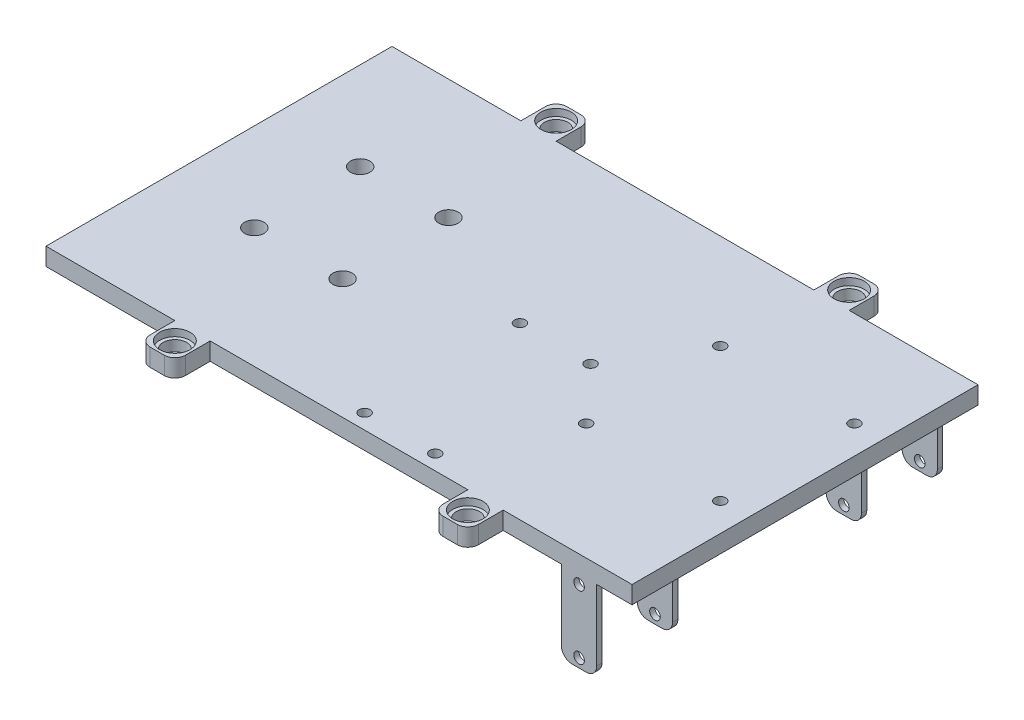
ISO-10303-21;
HEADER;
FILE_DESCRIPTION(('STEP AP214'),'2;1');
FILE_NAME('part.step','',(''),(''),'','','');
FILE_SCHEMA(('AUTOMOTIVE_DESIGN { 1 0 10303 214 1 1 1 1 }'));
ENDSEC;
DATA;
#1=APPLICATION_CONTEXT('core data for automotive mechanical design processes');
#2=APPLICATION_PROTOCOL_DEFINITION('international standard','automotive_design',2000,#1);
#3=PRODUCT_CONTEXT('',#1,'mechanical');
#4=PRODUCT('Part','Part','',(#3));
#5=PRODUCT_RELATED_PRODUCT_CATEGORY('part','',(#4));
#6=PRODUCT_DEFINITION_FORMATION('','',#4);
#7=PRODUCT_DEFINITION_CONTEXT('part definition',#1,'design');
#8=PRODUCT_DEFINITION('design','',#6,#7);
#9=PRODUCT_DEFINITION_SHAPE('','',#8);
#10=(LENGTH_UNIT() NAMED_UNIT(*) SI_UNIT(.MILLI.,.METRE.));
#11=(NAMED_UNIT(*) PLANE_ANGLE_UNIT() SI_UNIT($,.RADIAN.));
#12=(NAMED_UNIT(*) SI_UNIT($,.STERADIAN.) SOLID_ANGLE_UNIT());
#13=UNCERTAINTY_MEASURE_WITH_UNIT(LENGTH_MEASURE(1.E-05),#10,'distance_accuracy_value','');
#14=(GEOMETRIC_REPRESENTATION_CONTEXT(3) GLOBAL_UNCERTAINTY_ASSIGNED_CONTEXT((#13)) GLOBAL_UNIT_ASSIGNED_CONTEXT((#10,
#11,#12)) REPRESENTATION_CONTEXT('',''));
#15=CARTESIAN_POINT('',(0.,0.,0.));
#16=DIRECTION('',(0.,0.,1.));
#17=DIRECTION('',(1.,0.,0.));
#18=AXIS2_PLACEMENT_3D('',#15,#16,#17);
#19=CARTESIAN_POINT('',(65.3962034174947,-5.,-49.8583573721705));
#20=DIRECTION('',(0.,1.,0.));
#21=DIRECTION('',(0.,0.,1.));
#22=AXIS2_PLACEMENT_3D('',#19,#20,#21);
#23=CYLINDRICAL_SURFACE('',#22,3.3);
#24=CARTESIAN_POINT('',(65.3962034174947,-5.,-49.8583573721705));
#25=DIRECTION('',(0.,1.,0.));
#26=DIRECTION('',(0.,0.,1.));
#27=AXIS2_PLACEMENT_3D('',#24,#25,#26);
#28=CIRCLE('',#27,3.3);
#29=CARTESIAN_POINT('',(65.3962034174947,-5.,-46.5583573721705));
#30=VERTEX_POINT('',#29);
#31=EDGE_CURVE('E573',#30,#30,#28,.T.);
#32=ORIENTED_EDGE('',*,*,#31,.F.);
#33=EDGE_LOOP('',(#32));
#34=FACE_BOUND('',#33,.T.);
#35=CARTESIAN_POINT('',(65.3962034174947,-2.,-49.8583573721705));
#36=DIRECTION('',(0.,1.,0.));
#37=DIRECTION('',(0.,0.,1.));
#38=AXIS2_PLACEMENT_3D('',#35,#36,#37);
#39=CIRCLE('',#38,3.3);
#40=CARTESIAN_POINT('',(65.3962034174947,-2.,-46.5583573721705));
#41=VERTEX_POINT('',#40);
#42=EDGE_CURVE('E729',#41,#41,#39,.F.);
#43=ORIENTED_EDGE('',*,*,#42,.F.);
#44=EDGE_LOOP('',(#43));
#45=FACE_BOUND('',#44,.T.);
#46=ADVANCED_FACE('F63',(#34,#45),#23,.F.);
#47=CARTESIAN_POINT('',(-17.6037965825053,-5.,58.1416426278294));
#48=DIRECTION('',(0.,1.,0.));
#49=DIRECTION('',(0.,0.,1.));
#50=AXIS2_PLACEMENT_3D('',#47,#48,#49);
#51=CYLINDRICAL_SURFACE('',#50,3.3);
#52=CARTESIAN_POINT('',(-17.6037965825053,-5.,58.1416426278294));
#53=DIRECTION('',(0.,1.,0.));
#54=DIRECTION('',(0.,0.,-1.));
#55=AXIS2_PLACEMENT_3D('',#52,#53,#54);
#56=CIRCLE('',#55,3.3);
#57=CARTESIAN_POINT('',(-17.6037965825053,-5.,54.8416426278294));
#58=VERTEX_POINT('',#57);
#59=EDGE_CURVE('E572',#58,#58,#56,.T.);
#60=ORIENTED_EDGE('',*,*,#59,.F.);
#61=EDGE_LOOP('',(#60));
#62=FACE_BOUND('',#61,.T.);
#63=CARTESIAN_POINT('',(-17.6037965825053,-2.,58.1416426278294));
#64=DIRECTION('',(0.,1.,0.));
#65=DIRECTION('',(0.,0.,1.));
#66=AXIS2_PLACEMENT_3D('',#63,#64,#65);
#67=CIRCLE('',#66,3.3);
#68=CARTESIAN_POINT('',(-17.6037965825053,-2.,61.4416426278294));
#69=VERTEX_POINT('',#68);
#70=EDGE_CURVE('E722',#69,#69,#67,.F.);
#71=ORIENTED_EDGE('',*,*,#70,.F.);
#72=EDGE_LOOP('',(#71));
#73=FACE_BOUND('',#72,.T.);
#74=ADVANCED_FACE('F983',(#62,#73),#51,.F.);
#75=CARTESIAN_POINT('',(0.,-5.,0.));
#76=DIRECTION('',(0.,1.,0.));
#77=DIRECTION('',(0.,0.,1.));
#78=AXIS2_PLACEMENT_3D('',#75,#76,#77);
#79=PLANE('',#78);
#80=DIRECTION('',(0.,0.,1.));
#81=VECTOR('',#80,1.);
#82=CARTESIAN_POINT('',(96.8962034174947,-5.,31.6416426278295));
#83=LINE('',#82,#81);
#84=CARTESIAN_POINT('',(96.8962034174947,-5.,30.1416426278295));
#85=VERTEX_POINT('',#84);
#86=CARTESIAN_POINT('',(96.8962034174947,-5.,31.6416426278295));
#87=VERTEX_POINT('',#86);
#88=EDGE_CURVE('E447',#85,#87,#83,.T.);
#89=ORIENTED_EDGE('',*,*,#88,.F.);
#90=DIRECTION('',(1.,0.,0.));
#91=VECTOR('',#90,1.);
#92=CARTESIAN_POINT('',(96.8962034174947,-5.,30.1416426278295));
#93=LINE('',#92,#91);
#94=CARTESIAN_POINT('',(86.8962034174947,-5.,30.1416426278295));
#95=VERTEX_POINT('',#94);
#96=EDGE_CURVE('E437',#95,#85,#93,.T.);
#97=ORIENTED_EDGE('',*,*,#96,.F.);
#98=DIRECTION('',(0.,0.,-1.));
#99=VECTOR('',#98,1.);
#100=CARTESIAN_POINT('',(86.8962034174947,-5.,31.6416426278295));
#101=LINE('',#100,#99);
#102=CARTESIAN_POINT('',(86.8962034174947,-5.,31.6416426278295));
#103=VERTEX_POINT('',#102);
#104=EDGE_CURVE('E440',#103,#95,#101,.T.);
#105=ORIENTED_EDGE('',*,*,#104,.F.);
#106=DIRECTION('',(-1.,0.,0.));
#107=VECTOR('',#106,1.);
#108=CARTESIAN_POINT('',(96.8962034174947,-5.,31.6416426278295));
#109=LINE('',#108,#107);
#110=EDGE_CURVE('E444',#87,#103,#109,.T.);
#111=ORIENTED_EDGE('',*,*,#110,.F.);
#112=EDGE_LOOP('',(#89,#97,#105,#111));
#113=FACE_BOUND('',#112,.T.);
#114=CARTESIAN_POINT('',(60.8962034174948,-5.,-17.8583573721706));
#115=DIRECTION('',(0.,1.,0.));
#116=DIRECTION('',(0.,0.,1.));
#117=AXIS2_PLACEMENT_3D('',#114,#115,#116);
#118=CIRCLE('',#117,1.55);
#119=CARTESIAN_POINT('',(60.8962034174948,-5.,-16.3083573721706));
#120=VERTEX_POINT('',#119);
#121=EDGE_CURVE('E510',#120,#120,#118,.T.);
#122=ORIENTED_EDGE('',*,*,#121,.T.);
#123=EDGE_LOOP('',(#122));
#124=FACE_BOUND('',#123,.T.);
#125=CARTESIAN_POINT('',(46.8962034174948,-5.,4.89164262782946));
#126=DIRECTION('',(0.,1.,0.));
#127=DIRECTION('',(0.,0.,1.));
#128=AXIS2_PLACEMENT_3D('',#125,#126,#127);
#129=CIRCLE('',#128,1.55);
#130=CARTESIAN_POINT('',(46.8962034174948,-5.,6.44164262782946));
#131=VERTEX_POINT('',#130);
#132=EDGE_CURVE('E523',#131,#131,#129,.T.);
#133=ORIENTED_EDGE('',*,*,#132,.T.);
#134=EDGE_LOOP('',(#133));
#135=FACE_BOUND('',#134,.T.);
#136=CARTESIAN_POINT('',(26.8962034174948,-5.,4.89164262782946));
#137=DIRECTION('',(0.,1.,0.));
#138=DIRECTION('',(0.,0.,1.));
#139=AXIS2_PLACEMENT_3D('',#136,#137,#138);
#140=CIRCLE('',#139,1.55);
#141=CARTESIAN_POINT('',(26.8962034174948,-5.,6.44164262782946));
#142=VERTEX_POINT('',#141);
#143=EDGE_CURVE('E522',#142,#142,#140,.T.);
#144=ORIENTED_EDGE('',*,*,#143,.T.);
#145=EDGE_LOOP('',(#144));
#146=FACE_BOUND('',#145,.T.);
#147=CARTESIAN_POINT('',(46.8962034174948,-5.,48.8916426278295));
#148=DIRECTION('',(0.,1.,0.));
#149=DIRECTION('',(0.,0.,1.));
#150=AXIS2_PLACEMENT_3D('',#147,#148,#149);
#151=CIRCLE('',#150,1.55);
#152=CARTESIAN_POINT('',(46.8962034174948,-5.,50.4416426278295));
#153=VERTEX_POINT('',#152);
#154=EDGE_CURVE('E535',#153,#153,#151,.T.);
#155=ORIENTED_EDGE('',*,*,#154,.T.);
#156=EDGE_LOOP('',(#155));
#157=FACE_BOUND('',#156,.T.);
#158=CARTESIAN_POINT('',(98.8962034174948,-5.,20.1416426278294));
#159=DIRECTION('',(0.,1.,0.));
#160=DIRECTION('',(0.,0.,1.));
#161=AXIS2_PLACEMENT_3D('',#158,#159,#160);
#162=CIRCLE('',#161,1.54999999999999);
#163=CARTESIAN_POINT('',(98.8962034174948,-5.,21.6916426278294));
#164=VERTEX_POINT('',#163);
#165=EDGE_CURVE('E500',#164,#164,#162,.T.);
#166=ORIENTED_EDGE('',*,*,#165,.T.);
#167=EDGE_LOOP('',(#166));
#168=FACE_BOUND('',#167,.T.);
#169=CARTESIAN_POINT('',(98.8962034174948,-5.,-17.8583573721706));
#170=DIRECTION('',(0.,1.,0.));
#171=DIRECTION('',(0.,0.,1.));
#172=AXIS2_PLACEMENT_3D('',#169,#170,#171);
#173=CIRCLE('',#172,1.54999999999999);
#174=CARTESIAN_POINT('',(98.8962034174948,-5.,-16.3083573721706));
#175=VERTEX_POINT('',#174);
#176=EDGE_CURVE('E504',#175,#175,#173,.T.);
#177=ORIENTED_EDGE('',*,*,#176,.T.);
#178=EDGE_LOOP('',(#177));
#179=FACE_BOUND('',#178,.T.);
#180=CARTESIAN_POINT('',(60.8962034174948,-5.,20.1416426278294));
#181=DIRECTION('',(0.,1.,0.));
#182=DIRECTION('',(0.,0.,1.));
#183=AXIS2_PLACEMENT_3D('',#180,#181,#182);
#184=CIRCLE('',#183,1.55);
#185=CARTESIAN_POINT('',(60.8962034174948,-5.,21.6916426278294));
#186=VERTEX_POINT('',#185);
#187=EDGE_CURVE('E511',#186,#186,#184,.T.);
#188=ORIENTED_EDGE('',*,*,#187,.T.);
#189=EDGE_LOOP('',(#188));
#190=FACE_BOUND('',#189,.T.);
#191=CARTESIAN_POINT('',(26.8962034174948,-5.,48.8916426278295));
#192=DIRECTION('',(0.,1.,0.));
#193=DIRECTION('',(0.,0.,1.));
#194=AXIS2_PLACEMENT_3D('',#191,#192,#193);
#195=CIRCLE('',#194,1.55);
#196=CARTESIAN_POINT('',(26.8962034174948,-5.,50.4416426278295));
#197=VERTEX_POINT('',#196);
#198=EDGE_CURVE('E543',#197,#197,#195,.T.);
#199=ORIENTED_EDGE('',*,*,#198,.T.);
#200=EDGE_LOOP('',(#199));
#201=FACE_BOUND('',#200,.T.);
#202=CARTESIAN_POINT('',(-34.1037965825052,-5.,19.1416426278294));
#203=DIRECTION('',(0.,1.,0.));
#204=DIRECTION('',(0.,0.,1.));
#205=AXIS2_PLACEMENT_3D('',#202,#203,#204);
#206=CIRCLE('',#205,2.75);
#207=CARTESIAN_POINT('',(-34.1037965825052,-5.,21.8916426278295));
#208=VERTEX_POINT('',#207);
#209=EDGE_CURVE('E569',#208,#208,#206,.T.);
#210=ORIENTED_EDGE('',*,*,#209,.T.);
#211=EDGE_LOOP('',(#210));
#212=FACE_BOUND('',#211,.T.);
#213=CARTESIAN_POINT('',(-9.10379658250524,-5.,-10.8583573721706));
#214=DIRECTION('',(0.,1.,0.));
#215=DIRECTION('',(0.,0.,1.));
#216=AXIS2_PLACEMENT_3D('',#213,#214,#215);
#217=CIRCLE('',#216,2.75);
#218=CARTESIAN_POINT('',(-9.10379658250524,-5.,-8.10835737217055));
#219=VERTEX_POINT('',#218);
#220=EDGE_CURVE('E566',#219,#219,#217,.T.);
#221=ORIENTED_EDGE('',*,*,#220,.T.);
#222=EDGE_LOOP('',(#221));
#223=FACE_BOUND('',#222,.T.);
#224=CARTESIAN_POINT('',(-9.10379658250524,-5.,19.1416426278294));
#225=DIRECTION('',(0.,1.,0.));
#226=DIRECTION('',(0.,0.,1.));
#227=AXIS2_PLACEMENT_3D('',#224,#225,#226);
#228=CIRCLE('',#227,2.75);
#229=CARTESIAN_POINT('',(-9.10379658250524,-5.,21.8916426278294));
#230=VERTEX_POINT('',#229);
#231=EDGE_CURVE('E563',#230,#230,#228,.T.);
#232=ORIENTED_EDGE('',*,*,#231,.T.);
#233=EDGE_LOOP('',(#232));
#234=FACE_BOUND('',#233,.T.);
#235=CARTESIAN_POINT('',(-34.1037965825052,-5.,-10.8583573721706));
#236=DIRECTION('',(0.,1.,0.));
#237=DIRECTION('',(0.,0.,1.));
#238=AXIS2_PLACEMENT_3D('',#235,#236,#237);
#239=CIRCLE('',#238,2.75);
#240=CARTESIAN_POINT('',(-34.1037965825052,-5.,-8.10835737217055));
#241=VERTEX_POINT('',#240);
#242=EDGE_CURVE('E560',#241,#241,#239,.T.);
#243=ORIENTED_EDGE('',*,*,#242,.T.);
#244=EDGE_LOOP('',(#243));
#245=FACE_BOUND('',#244,.T.);
#246=ORIENTED_EDGE('',*,*,#59,.T.);
#247=EDGE_LOOP('',(#246));
#248=FACE_BOUND('',#247,.T.);
#249=CARTESIAN_POINT('',(65.3962034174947,-5.,58.1416426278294));
#250=DIRECTION('',(0.,1.,0.));
#251=DIRECTION('',(0.,0.,-1.));
#252=AXIS2_PLACEMENT_3D('',#249,#250,#251);
#253=CIRCLE('',#252,3.3);
#254=CARTESIAN_POINT('',(65.3962034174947,-5.,54.8416426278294));
#255=VERTEX_POINT('',#254);
#256=EDGE_CURVE('E577',#255,#255,#253,.T.);
#257=ORIENTED_EDGE('',*,*,#256,.T.);
#258=EDGE_LOOP('',(#257));
#259=FACE_BOUND('',#258,.T.);
#260=ORIENTED_EDGE('',*,*,#31,.T.);
#261=EDGE_LOOP('',(#260));
#262=FACE_BOUND('',#261,.T.);
#263=CARTESIAN_POINT('',(-17.6037965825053,-5.,-49.8583573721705));
#264=DIRECTION('',(0.,1.,0.));
#265=DIRECTION('',(0.,0.,1.));
#266=AXIS2_PLACEMENT_3D('',#263,#264,#265);
#267=CIRCLE('',#266,3.3);
#268=CARTESIAN_POINT('',(-17.6037965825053,-5.,-46.5583573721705));
#269=VERTEX_POINT('',#268);
#270=EDGE_CURVE('E576',#269,#269,#267,.T.);
#271=ORIENTED_EDGE('',*,*,#270,.T.);
#272=EDGE_LOOP('',(#271));
#273=FACE_BOUND('',#272,.T.);
#274=DIRECTION('',(1.,0.,0.));
#275=VECTOR('',#274,1.);
#276=CARTESIAN_POINT('',(60.3962034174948,-5.,63.1416426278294));
#277=LINE('',#276,#275);
#278=CARTESIAN_POINT('',(63.3962034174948,-5.,63.1416426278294));
#279=VERTEX_POINT('',#278);
#280=CARTESIAN_POINT('',(67.3962034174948,-5.,63.1416426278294));
#281=VERTEX_POINT('',#280);
#282=EDGE_CURVE('E595',#279,#281,#277,.T.);
#283=ORIENTED_EDGE('',*,*,#282,.F.);
#284=CARTESIAN_POINT('',(63.3962034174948,-5.,60.1416426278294));
#285=DIRECTION('',(0.,1.,0.));
#286=DIRECTION('',(0.,0.,1.));
#287=AXIS2_PLACEMENT_3D('',#284,#285,#286);
#288=CIRCLE('',#287,3.);
#289=CARTESIAN_POINT('',(60.3962034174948,-5.,60.1416426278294));
#290=VERTEX_POINT('',#289);
#291=EDGE_CURVE('E843',#279,#290,#288,.F.);
#292=ORIENTED_EDGE('',*,*,#291,.T.);
#293=DIRECTION('',(0.,0.,1.));
#294=VECTOR('',#293,1.);
#295=CARTESIAN_POINT('',(60.3962034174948,-5.,53.1416426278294));
#296=LINE('',#295,#294);
#297=CARTESIAN_POINT('',(60.3962034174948,-5.,53.1416426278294));
#298=VERTEX_POINT('',#297);
#299=EDGE_CURVE('E588',#298,#290,#296,.T.);
#300=ORIENTED_EDGE('',*,*,#299,.F.);
#301=DIRECTION('',(1.,0.,0.));
#302=VECTOR('',#301,1.);
#303=CARTESIAN_POINT('',(0.,-5.,53.1416426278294));
#304=LINE('',#303,#302);
#305=CARTESIAN_POINT('',(-12.6037965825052,-5.,53.1416426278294));
#306=VERTEX_POINT('',#305);
#307=EDGE_CURVE('E687',#306,#298,#304,.T.);
#308=ORIENTED_EDGE('',*,*,#307,.F.);
#309=DIRECTION('',(0.,0.,-1.));
#310=VECTOR('',#309,1.);
#311=CARTESIAN_POINT('',(-12.6037965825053,-5.,0.));
#312=LINE('',#311,#310);
#313=CARTESIAN_POINT('',(-12.6037965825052,-5.,60.1416426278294));
#314=VERTEX_POINT('',#313);
#315=EDGE_CURVE('E651',#314,#306,#312,.T.);
#316=ORIENTED_EDGE('',*,*,#315,.F.);
#317=CARTESIAN_POINT('',(-15.6037965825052,-5.,60.1416426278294));
#318=DIRECTION('',(0.,1.,0.));
#319=DIRECTION('',(0.,0.,1.));
#320=AXIS2_PLACEMENT_3D('',#317,#318,#319);
#321=CIRCLE('',#320,3.);
#322=CARTESIAN_POINT('',(-15.6037965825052,-5.,63.1416426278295));
#323=VERTEX_POINT('',#322);
#324=EDGE_CURVE('E837',#314,#323,#321,.F.);
#325=ORIENTED_EDGE('',*,*,#324,.T.);
#326=DIRECTION('',(1.,0.,0.));
#327=VECTOR('',#326,1.);
#328=CARTESIAN_POINT('',(0.,-5.,63.1416426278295));
#329=LINE('',#328,#327);
#330=CARTESIAN_POINT('',(-19.6037965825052,-5.,63.1416426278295));
#331=VERTEX_POINT('',#330);
#332=EDGE_CURVE('E648',#331,#323,#329,.T.);
#333=ORIENTED_EDGE('',*,*,#332,.F.);
#334=CARTESIAN_POINT('',(-19.6037965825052,-5.,60.1416426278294));
#335=DIRECTION('',(0.,1.,0.));
#336=DIRECTION('',(0.,0.,1.));
#337=AXIS2_PLACEMENT_3D('',#334,#335,#336);
#338=CIRCLE('',#337,3.);
#339=CARTESIAN_POINT('',(-22.6037965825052,-5.,60.1416426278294));
#340=VERTEX_POINT('',#339);
#341=EDGE_CURVE('E839',#331,#340,#338,.F.);
#342=ORIENTED_EDGE('',*,*,#341,.T.);
#343=DIRECTION('',(0.,0.,1.));
#344=VECTOR('',#343,1.);
#345=CARTESIAN_POINT('',(-22.6037965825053,-5.,0.));
#346=LINE('',#345,#344);
#347=CARTESIAN_POINT('',(-22.6037965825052,-5.,53.1416426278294));
#348=VERTEX_POINT('',#347);
#349=EDGE_CURVE('E654',#348,#340,#346,.T.);
#350=ORIENTED_EDGE('',*,*,#349,.F.);
#351=CARTESIAN_POINT('',(-59.1037965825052,-5.,53.1416426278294));
#352=VERTEX_POINT('',#351);
#353=EDGE_CURVE('E683',#352,#348,#304,.T.);
#354=ORIENTED_EDGE('',*,*,#353,.F.);
#355=DIRECTION('',(0.,0.,1.));
#356=VECTOR('',#355,1.);
#357=CARTESIAN_POINT('',(-59.1037965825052,-5.,0.));
#358=LINE('',#357,#356);
#359=CARTESIAN_POINT('',(-59.1037965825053,-5.,-44.8583573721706));
#360=VERTEX_POINT('',#359);
#361=EDGE_CURVE('E678',#360,#352,#358,.T.);
#362=ORIENTED_EDGE('',*,*,#361,.F.);
#363=DIRECTION('',(1.,0.,0.));
#364=VECTOR('',#363,1.);
#365=CARTESIAN_POINT('',(0.,-5.,-44.8583573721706));
#366=LINE('',#365,#364);
#367=CARTESIAN_POINT('',(-22.6037965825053,-5.,-44.8583573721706));
#368=VERTEX_POINT('',#367);
#369=EDGE_CURVE('E675',#360,#368,#366,.T.);
#370=ORIENTED_EDGE('',*,*,#369,.T.);
#371=DIRECTION('',(0.,0.,-1.));
#372=VECTOR('',#371,1.);
#373=CARTESIAN_POINT('',(-22.6037965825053,-5.,-44.8583573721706));
#374=LINE('',#373,#372);
#375=CARTESIAN_POINT('',(-22.6037965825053,-5.,-51.8583573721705));
#376=VERTEX_POINT('',#375);
#377=EDGE_CURVE('E631',#368,#376,#374,.T.);
#378=ORIENTED_EDGE('',*,*,#377,.T.);
#379=CARTESIAN_POINT('',(-19.6037965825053,-5.,-51.8583573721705));
#380=DIRECTION('',(0.,1.,0.));
#381=DIRECTION('',(0.,0.,1.));
#382=AXIS2_PLACEMENT_3D('',#379,#380,#381);
#383=CIRCLE('',#382,3.);
#384=CARTESIAN_POINT('',(-19.6037965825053,-5.,-54.8583573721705));
#385=VERTEX_POINT('',#384);
#386=EDGE_CURVE('E833',#376,#385,#383,.F.);
#387=ORIENTED_EDGE('',*,*,#386,.T.);
#388=DIRECTION('',(1.,0.,0.));
#389=VECTOR('',#388,1.);
#390=CARTESIAN_POINT('',(-22.6037965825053,-5.,-54.8583573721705));
#391=LINE('',#390,#389);
#392=CARTESIAN_POINT('',(-15.6037965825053,-5.,-54.8583573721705));
#393=VERTEX_POINT('',#392);
#394=EDGE_CURVE('E636',#385,#393,#391,.T.);
#395=ORIENTED_EDGE('',*,*,#394,.T.);
#396=CARTESIAN_POINT('',(-15.6037965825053,-5.,-51.8583573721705));
#397=DIRECTION('',(0.,1.,0.));
#398=DIRECTION('',(0.,0.,1.));
#399=AXIS2_PLACEMENT_3D('',#396,#397,#398);
#400=CIRCLE('',#399,3.);
#401=CARTESIAN_POINT('',(-12.6037965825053,-5.,-51.8583573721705));
#402=VERTEX_POINT('',#401);
#403=EDGE_CURVE('E835',#393,#402,#400,.F.);
#404=ORIENTED_EDGE('',*,*,#403,.T.);
#405=DIRECTION('',(0.,0.,1.));
#406=VECTOR('',#405,1.);
#407=CARTESIAN_POINT('',(-12.6037965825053,-5.,-54.8583573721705));
#408=LINE('',#407,#406);
#409=CARTESIAN_POINT('',(-12.6037965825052,-5.,-44.8583573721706));
#410=VERTEX_POINT('',#409);
#411=EDGE_CURVE('E644',#402,#410,#408,.T.);
#412=ORIENTED_EDGE('',*,*,#411,.T.);
#413=CARTESIAN_POINT('',(60.3962034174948,-5.,-44.8583573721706));
#414=VERTEX_POINT('',#413);
#415=EDGE_CURVE('E679',#410,#414,#366,.T.);
#416=ORIENTED_EDGE('',*,*,#415,.T.);
#417=DIRECTION('',(0.,0.,-1.));
#418=VECTOR('',#417,1.);
#419=CARTESIAN_POINT('',(60.3962034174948,-5.,-44.8583573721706));
#420=LINE('',#419,#418);
#421=CARTESIAN_POINT('',(60.3962034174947,-5.,-51.8583573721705));
#422=VERTEX_POINT('',#421);
#423=EDGE_CURVE('E612',#414,#422,#420,.T.);
#424=ORIENTED_EDGE('',*,*,#423,.T.);
#425=CARTESIAN_POINT('',(63.3962034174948,-5.,-51.8583573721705));
#426=DIRECTION('',(0.,1.,0.));
#427=DIRECTION('',(0.,0.,1.));
#428=AXIS2_PLACEMENT_3D('',#425,#426,#427);
#429=CIRCLE('',#428,3.);
#430=CARTESIAN_POINT('',(63.3962034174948,-5.,-54.8583573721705));
#431=VERTEX_POINT('',#430);
#432=EDGE_CURVE('E830',#422,#431,#429,.F.);
#433=ORIENTED_EDGE('',*,*,#432,.T.);
#434=DIRECTION('',(1.,0.,0.));
#435=VECTOR('',#434,1.);
#436=CARTESIAN_POINT('',(60.3962034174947,-5.,-54.8583573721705));
#437=LINE('',#436,#435);
#438=CARTESIAN_POINT('',(67.3962034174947,-5.,-54.8583573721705));
#439=VERTEX_POINT('',#438);
#440=EDGE_CURVE('E617',#431,#439,#437,.T.);
#441=ORIENTED_EDGE('',*,*,#440,.T.);
#442=CARTESIAN_POINT('',(67.3962034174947,-5.,-51.8583573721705));
#443=DIRECTION('',(0.,1.,0.));
#444=DIRECTION('',(0.,0.,1.));
#445=AXIS2_PLACEMENT_3D('',#442,#443,#444);
#446=CIRCLE('',#445,3.);
#447=CARTESIAN_POINT('',(70.3962034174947,-5.,-51.8583573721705));
#448=VERTEX_POINT('',#447);
#449=EDGE_CURVE('E78',#439,#448,#446,.F.);
#450=ORIENTED_EDGE('',*,*,#449,.T.);
#451=DIRECTION('',(0.,0.,1.));
#452=VECTOR('',#451,1.);
#453=CARTESIAN_POINT('',(70.3962034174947,-5.,-54.8583573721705));
#454=LINE('',#453,#452);
#455=CARTESIAN_POINT('',(70.3962034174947,-5.,-44.8583573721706));
#456=VERTEX_POINT('',#455);
#457=EDGE_CURVE('E624',#448,#456,#454,.T.);
#458=ORIENTED_EDGE('',*,*,#457,.T.);
#459=CARTESIAN_POINT('',(86.8962034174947,-5.,-44.8583573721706));
#460=VERTEX_POINT('',#459);
#461=EDGE_CURVE('E892',#456,#460,#366,.T.);
#462=ORIENTED_EDGE('',*,*,#461,.T.);
#463=DIRECTION('',(0.,0.,-1.));
#464=VECTOR('',#463,1.);
#465=CARTESIAN_POINT('',(86.8962034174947,-5.,-44.8583573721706));
#466=LINE('',#465,#464);
#467=CARTESIAN_POINT('',(86.8962034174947,-5.,-43.3583573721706));
#468=VERTEX_POINT('',#467);
#469=EDGE_CURVE('E463',#468,#460,#466,.T.);
#470=ORIENTED_EDGE('',*,*,#469,.F.);
#471=DIRECTION('',(-1.,0.,0.));
#472=VECTOR('',#471,1.);
#473=CARTESIAN_POINT('',(86.8962034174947,-5.,-43.3583573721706));
#474=LINE('',#473,#472);
#475=CARTESIAN_POINT('',(96.8962034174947,-5.,-43.3583573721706));
#476=VERTEX_POINT('',#475);
#477=EDGE_CURVE('E466',#476,#468,#474,.T.);
#478=ORIENTED_EDGE('',*,*,#477,.F.);
#479=DIRECTION('',(0.,0.,1.));
#480=VECTOR('',#479,1.);
#481=CARTESIAN_POINT('',(96.8962034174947,-5.,-44.8583573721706));
#482=LINE('',#481,#480);
#483=CARTESIAN_POINT('',(96.8962034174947,-5.,-44.8583573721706));
#484=VERTEX_POINT('',#483);
#485=EDGE_CURVE('E470',#484,#476,#482,.T.);
#486=ORIENTED_EDGE('',*,*,#485,.F.);
#487=CARTESIAN_POINT('',(106.896203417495,-5.,-44.8583573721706));
#488=VERTEX_POINT('',#487);
#489=EDGE_CURVE('E673',#484,#488,#366,.T.);
#490=ORIENTED_EDGE('',*,*,#489,.T.);
#491=DIRECTION('',(0.,0.,1.));
#492=VECTOR('',#491,1.);
#493=CARTESIAN_POINT('',(106.896203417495,-5.,0.));
#494=LINE('',#493,#492);
#495=CARTESIAN_POINT('',(106.896203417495,-5.,53.1416426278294));
#496=VERTEX_POINT('',#495);
#497=EDGE_CURVE('E670',#488,#496,#494,.T.);
#498=ORIENTED_EDGE('',*,*,#497,.T.);
#499=CARTESIAN_POINT('',(96.8962034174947,-5.,53.1416426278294));
#500=VERTEX_POINT('',#499);
#501=EDGE_CURVE('E682',#500,#496,#304,.T.);
#502=ORIENTED_EDGE('',*,*,#501,.F.);
#503=DIRECTION('',(0.,0.,1.));
#504=VECTOR('',#503,1.);
#505=CARTESIAN_POINT('',(96.8962034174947,-5.,53.1416426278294));
#506=LINE('',#505,#504);
#507=CARTESIAN_POINT('',(96.8962034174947,-5.,51.6416426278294));
#508=VERTEX_POINT('',#507);
#509=EDGE_CURVE('E482',#508,#500,#506,.T.);
#510=ORIENTED_EDGE('',*,*,#509,.F.);
#511=DIRECTION('',(1.,0.,0.));
#512=VECTOR('',#511,1.);
#513=CARTESIAN_POINT('',(86.8962034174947,-5.,51.6416426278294));
#514=LINE('',#513,#512);
#515=CARTESIAN_POINT('',(86.8962034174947,-5.,51.6416426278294));
#516=VERTEX_POINT('',#515);
#517=EDGE_CURVE('E488',#516,#508,#514,.T.);
#518=ORIENTED_EDGE('',*,*,#517,.F.);
#519=DIRECTION('',(0.,0.,-1.));
#520=VECTOR('',#519,1.);
#521=CARTESIAN_POINT('',(86.8962034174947,-5.,53.1416426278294));
#522=LINE('',#521,#520);
#523=CARTESIAN_POINT('',(86.8962034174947,-5.,53.1416426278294));
#524=VERTEX_POINT('',#523);
#525=EDGE_CURVE('E473',#524,#516,#522,.T.);
#526=ORIENTED_EDGE('',*,*,#525,.F.);
#527=CARTESIAN_POINT('',(70.3962034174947,-5.,53.1416426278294));
#528=VERTEX_POINT('',#527);
#529=EDGE_CURVE('E916',#528,#524,#304,.T.);
#530=ORIENTED_EDGE('',*,*,#529,.F.);
#531=DIRECTION('',(0.,0.,-1.));
#532=VECTOR('',#531,1.);
#533=CARTESIAN_POINT('',(70.3962034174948,-5.,63.1416426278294));
#534=LINE('',#533,#532);
#535=CARTESIAN_POINT('',(70.3962034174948,-5.,60.1416426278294));
#536=VERTEX_POINT('',#535);
#537=EDGE_CURVE('E603',#536,#528,#534,.T.);
#538=ORIENTED_EDGE('',*,*,#537,.F.);
#539=CARTESIAN_POINT('',(67.3962034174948,-5.,60.1416426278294));
#540=DIRECTION('',(0.,1.,0.));
#541=DIRECTION('',(0.,0.,1.));
#542=AXIS2_PLACEMENT_3D('',#539,#540,#541);
#543=CIRCLE('',#542,3.);
#544=EDGE_CURVE('E841',#536,#281,#543,.F.);
#545=ORIENTED_EDGE('',*,*,#544,.T.);
#546=EDGE_LOOP('',(#283,#292,#300,#308,#316,#325,#333,#342,#350,#354,#362,#370,#378,#387,#395,
#404,#412,#416,#424,#433,#441,#450,#458,#462,#470,#478,#486,#490,#498,#502,#510,#518,#526,#530,
#538,#545));
#547=FACE_BOUND('',#546,.T.);
#548=DIRECTION('',(1.,0.,0.));
#549=VECTOR('',#548,1.);
#550=CARTESIAN_POINT('',(96.8962034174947,-5.,-23.3583573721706));
#551=LINE('',#550,#549);
#552=CARTESIAN_POINT('',(86.8962034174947,-5.,-23.3583573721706));
#553=VERTEX_POINT('',#552);
#554=CARTESIAN_POINT('',(96.8962034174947,-5.,-23.3583573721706));
#555=VERTEX_POINT('',#554);
#556=EDGE_CURVE('E397',#553,#555,#551,.T.);
#557=ORIENTED_EDGE('',*,*,#556,.F.);
#558=DIRECTION('',(0.,0.,-1.));
#559=VECTOR('',#558,1.);
#560=CARTESIAN_POINT('',(86.8962034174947,-5.,-23.3583573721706));
#561=LINE('',#560,#559);
#562=CARTESIAN_POINT('',(86.8962034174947,-5.,-21.8583573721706));
#563=VERTEX_POINT('',#562);
#564=EDGE_CURVE('E410',#563,#553,#561,.T.);
#565=ORIENTED_EDGE('',*,*,#564,.F.);
#566=DIRECTION('',(-1.,0.,0.));
#567=VECTOR('',#566,1.);
#568=CARTESIAN_POINT('',(96.8962034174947,-5.,-21.8583573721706));
#569=LINE('',#568,#567);
#570=CARTESIAN_POINT('',(96.8962034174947,-5.,-21.8583573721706));
#571=VERTEX_POINT('',#570);
#572=EDGE_CURVE('E418',#571,#563,#569,.T.);
#573=ORIENTED_EDGE('',*,*,#572,.F.);
#574=DIRECTION('',(0.,0.,1.));
#575=VECTOR('',#574,1.);
#576=CARTESIAN_POINT('',(96.8962034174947,-5.,-23.3583573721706));
#577=LINE('',#576,#575);
#578=EDGE_CURVE('E413',#555,#571,#577,.T.);
#579=ORIENTED_EDGE('',*,*,#578,.F.);
#580=EDGE_LOOP('',(#557,#565,#573,#579));
#581=FACE_BOUND('',#580,.T.);
#582=ADVANCED_FACE('F408',(#113,#124,#135,#146,#157,#168,#179,#190,#201,#212,#223,#234,#245,
#248,#259,#262,#273,#547,#581),#79,.F.);
#583=CARTESIAN_POINT('',(0.,-5.,53.1416426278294));
#584=DIRECTION('',(0.,0.,1.));
#585=DIRECTION('',(1.,0.,0.));
#586=AXIS2_PLACEMENT_3D('',#583,#584,#585);
#587=PLANE('',#586);
#588=DIRECTION('',(0.,1.,0.));
#589=VECTOR('',#588,1.);
#590=CARTESIAN_POINT('',(60.3962034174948,-5.,53.1416426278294));
#591=LINE('',#590,#589);
#592=CARTESIAN_POINT('',(60.3962034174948,0.,53.1416426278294));
#593=VERTEX_POINT('',#592);
#594=EDGE_CURVE('E584',#298,#593,#591,.T.);
#595=ORIENTED_EDGE('',*,*,#594,.T.);
#596=DIRECTION('',(1.,0.,0.));
#597=VECTOR('',#596,1.);
#598=CARTESIAN_POINT('',(0.,0.,53.1416426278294));
#599=LINE('',#598,#597);
#600=CARTESIAN_POINT('',(-12.6037965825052,0.,53.1416426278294));
#601=VERTEX_POINT('',#600);
#602=EDGE_CURVE('E701',#601,#593,#599,.T.);
#603=ORIENTED_EDGE('',*,*,#602,.F.);
#604=DIRECTION('',(0.,1.,0.));
#605=VECTOR('',#604,1.);
#606=CARTESIAN_POINT('',(-12.6037965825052,-5.,53.1416426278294));
#607=LINE('',#606,#605);
#608=EDGE_CURVE('E657',#306,#601,#607,.T.);
#609=ORIENTED_EDGE('',*,*,#608,.F.);
#610=ORIENTED_EDGE('',*,*,#307,.T.);
#611=EDGE_LOOP('',(#595,#603,#609,#610));
#612=FACE_BOUND('',#611,.T.);
#613=ADVANCED_FACE('F923',(#612),#587,.T.);
#614=CARTESIAN_POINT('',(0.,-5.,-44.8583573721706));
#615=DIRECTION('',(0.,0.,1.));
#616=DIRECTION('',(1.,0.,0.));
#617=AXIS2_PLACEMENT_3D('',#614,#615,#616);
#618=PLANE('',#617);
#619=CARTESIAN_POINT('',(91.8962034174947,-25.5,-44.8583573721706));
#620=DIRECTION('',(0.,0.,1.));
#621=DIRECTION('',(1.,0.,0.));
#622=AXIS2_PLACEMENT_3D('',#619,#620,#621);
#623=CIRCLE('',#622,1.5);
#624=CARTESIAN_POINT('',(93.3962034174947,-25.5,-44.8583573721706));
#625=VERTEX_POINT('',#624);
#626=EDGE_CURVE('E1945',#625,#625,#623,.T.);
#627=ORIENTED_EDGE('',*,*,#626,.T.);
#628=EDGE_LOOP('',(#627));
#629=FACE_BOUND('',#628,.T.);
#630=CARTESIAN_POINT('',(91.8962034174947,-7.5,-44.8583573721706));
#631=DIRECTION('',(0.,0.,1.));
#632=DIRECTION('',(1.,0.,0.));
#633=AXIS2_PLACEMENT_3D('',#630,#631,#632);
#634=CIRCLE('',#633,1.5);
#635=CARTESIAN_POINT('',(93.3962034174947,-7.5,-44.8583573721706));
#636=VERTEX_POINT('',#635);
#637=EDGE_CURVE('E721',#636,#636,#634,.T.);
#638=ORIENTED_EDGE('',*,*,#637,.T.);
#639=EDGE_LOOP('',(#638));
#640=FACE_BOUND('',#639,.T.);
#641=DIRECTION('',(1.,0.,0.));
#642=VECTOR('',#641,1.);
#643=CARTESIAN_POINT('',(86.8962034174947,-28.,-44.8583573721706));
#644=LINE('',#643,#642);
#645=CARTESIAN_POINT('',(89.8962034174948,-28.,-44.8583573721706));
#646=VERTEX_POINT('',#645);
#647=CARTESIAN_POINT('',(93.8962034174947,-28.,-44.8583573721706));
#648=VERTEX_POINT('',#647);
#649=EDGE_CURVE('E467',#646,#648,#644,.T.);
#650=ORIENTED_EDGE('',*,*,#649,.F.);
#651=CARTESIAN_POINT('',(89.8962034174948,-25.,-44.8583573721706));
#652=DIRECTION('',(0.,0.,1.));
#653=DIRECTION('',(1.,0.,0.));
#654=AXIS2_PLACEMENT_3D('',#651,#652,#653);
#655=CIRCLE('',#654,3.);
#656=CARTESIAN_POINT('',(86.8962034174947,-25.,-44.8583573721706));
#657=VERTEX_POINT('',#656);
#658=EDGE_CURVE('E790',#646,#657,#655,.F.);
#659=ORIENTED_EDGE('',*,*,#658,.T.);
#660=DIRECTION('',(0.,1.,0.));
#661=VECTOR('',#660,1.);
#662=CARTESIAN_POINT('',(86.8962034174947,-28.,-44.8583573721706));
#663=LINE('',#662,#661);
#664=EDGE_CURVE('E460',#657,#460,#663,.T.);
#665=ORIENTED_EDGE('',*,*,#664,.T.);
#666=ORIENTED_EDGE('',*,*,#461,.F.);
#667=DIRECTION('',(0.,1.,0.));
#668=VECTOR('',#667,1.);
#669=CARTESIAN_POINT('',(70.3962034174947,-5.,-44.8583573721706));
#670=LINE('',#669,#668);
#671=CARTESIAN_POINT('',(70.3962034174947,0.,-44.8583573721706));
#672=VERTEX_POINT('',#671);
#673=EDGE_CURVE('E600',#456,#672,#670,.T.);
#674=ORIENTED_EDGE('',*,*,#673,.T.);
#675=DIRECTION('',(1.,0.,0.));
#676=VECTOR('',#675,1.);
#677=CARTESIAN_POINT('',(0.,0.,-44.8583573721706));
#678=LINE('',#677,#676);
#679=CARTESIAN_POINT('',(106.896203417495,0.,-44.8583573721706));
#680=VERTEX_POINT('',#679);
#681=EDGE_CURVE('E690',#672,#680,#678,.T.);
#682=ORIENTED_EDGE('',*,*,#681,.T.);
#683=DIRECTION('',(0.,1.,0.));
#684=VECTOR('',#683,1.);
#685=CARTESIAN_POINT('',(106.896203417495,-5.,-44.8583573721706));
#686=LINE('',#685,#684);
#687=EDGE_CURVE('E686',#488,#680,#686,.T.);
#688=ORIENTED_EDGE('',*,*,#687,.F.);
#689=ORIENTED_EDGE('',*,*,#489,.F.);
#690=DIRECTION('',(0.,1.,0.));
#691=VECTOR('',#690,1.);
#692=CARTESIAN_POINT('',(96.8962034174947,-28.,-44.8583573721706));
#693=LINE('',#692,#691);
#694=CARTESIAN_POINT('',(96.8962034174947,-25.,-44.8583573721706));
#695=VERTEX_POINT('',#694);
#696=EDGE_CURVE('E450',#695,#484,#693,.T.);
#697=ORIENTED_EDGE('',*,*,#696,.F.);
#698=CARTESIAN_POINT('',(93.8962034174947,-25.,-44.8583573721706));
#699=DIRECTION('',(0.,0.,1.));
#700=DIRECTION('',(1.,0.,0.));
#701=AXIS2_PLACEMENT_3D('',#698,#699,#700);
#702=CIRCLE('',#701,3.);
#703=EDGE_CURVE('E788',#695,#648,#702,.F.);
#704=ORIENTED_EDGE('',*,*,#703,.T.);
#705=EDGE_LOOP('',(#650,#659,#665,#666,#674,#682,#688,#689,#697,#704));
#706=FACE_BOUND('',#705,.T.);
#707=ADVANCED_FACE('F895',(#629,#640,#706),#618,.F.);
#708=DIRECTION('',(0.,1.,0.));
#709=VECTOR('',#708,1.);
#710=CARTESIAN_POINT('',(60.3962034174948,-5.,-44.8583573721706));
#711=LINE('',#710,#709);
#712=CARTESIAN_POINT('',(60.3962034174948,0.,-44.8583573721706));
#713=VERTEX_POINT('',#712);
#714=EDGE_CURVE('E609',#414,#713,#711,.T.);
#715=ORIENTED_EDGE('',*,*,#714,.F.);
#716=ORIENTED_EDGE('',*,*,#415,.F.);
#717=DIRECTION('',(0.,1.,0.));
#718=VECTOR('',#717,1.);
#719=CARTESIAN_POINT('',(-12.6037965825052,-5.,-44.8583573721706));
#720=LINE('',#719,#718);
#721=CARTESIAN_POINT('',(-12.6037965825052,0.,-44.8583573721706));
#722=VERTEX_POINT('',#721);
#723=EDGE_CURVE('E621',#410,#722,#720,.T.);
#724=ORIENTED_EDGE('',*,*,#723,.T.);
#725=EDGE_CURVE('E695',#722,#713,#678,.T.);
#726=ORIENTED_EDGE('',*,*,#725,.T.);
#727=EDGE_LOOP('',(#715,#716,#724,#726));
#728=FACE_BOUND('',#727,.T.);
#729=ADVANCED_FACE('F1060',(#728),#618,.F.);
#730=DIRECTION('',(0.,1.,0.));
#731=VECTOR('',#730,1.);
#732=CARTESIAN_POINT('',(-22.6037965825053,-5.,-44.8583573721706));
#733=LINE('',#732,#731);
#734=CARTESIAN_POINT('',(-22.6037965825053,0.,-44.8583573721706));
#735=VERTEX_POINT('',#734);
#736=EDGE_CURVE('E629',#368,#735,#733,.T.);
#737=ORIENTED_EDGE('',*,*,#736,.F.);
#738=ORIENTED_EDGE('',*,*,#369,.F.);
#739=DIRECTION('',(0.,1.,0.));
#740=VECTOR('',#739,1.);
#741=CARTESIAN_POINT('',(-59.1037965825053,-5.,-44.8583573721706));
#742=LINE('',#741,#740);
#743=CARTESIAN_POINT('',(-59.1037965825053,0.,-44.8583573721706));
#744=VERTEX_POINT('',#743);
#745=EDGE_CURVE('E708',#360,#744,#742,.T.);
#746=ORIENTED_EDGE('',*,*,#745,.T.);
#747=EDGE_CURVE('E691',#744,#735,#678,.T.);
#748=ORIENTED_EDGE('',*,*,#747,.T.);
#749=EDGE_LOOP('',(#737,#738,#746,#748));
#750=FACE_BOUND('',#749,.T.);
#751=ADVANCED_FACE('F1062',(#750),#618,.F.);
#752=ORIENTED_EDGE('',*,*,#353,.T.);
#753=DIRECTION('',(0.,1.,0.));
#754=VECTOR('',#753,1.);
#755=CARTESIAN_POINT('',(-22.6037965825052,-5.,53.1416426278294));
#756=LINE('',#755,#754);
#757=CARTESIAN_POINT('',(-22.6037965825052,0.,53.1416426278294));
#758=VERTEX_POINT('',#757);
#759=EDGE_CURVE('E664',#348,#758,#756,.T.);
#760=ORIENTED_EDGE('',*,*,#759,.T.);
#761=CARTESIAN_POINT('',(-59.1037965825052,0.,53.1416426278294));
#762=VERTEX_POINT('',#761);
#763=EDGE_CURVE('E674',#762,#758,#599,.T.);
#764=ORIENTED_EDGE('',*,*,#763,.F.);
#765=DIRECTION('',(0.,1.,0.));
#766=VECTOR('',#765,1.);
#767=CARTESIAN_POINT('',(-59.1037965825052,-5.,53.1416426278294));
#768=LINE('',#767,#766);
#769=EDGE_CURVE('E706',#352,#762,#768,.T.);
#770=ORIENTED_EDGE('',*,*,#769,.F.);
#771=EDGE_LOOP('',(#752,#760,#764,#770));
#772=FACE_BOUND('',#771,.T.);
#773=ADVANCED_FACE('F1054',(#772),#587,.T.);
#774=CARTESIAN_POINT('',(106.896203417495,-5.,0.));
#775=DIRECTION('',(-1.,0.,0.));
#776=DIRECTION('',(0.,0.,1.));
#777=AXIS2_PLACEMENT_3D('',#774,#775,#776);
#778=PLANE('',#777);
#779=DIRECTION('',(0.,0.,1.));
#780=VECTOR('',#779,1.);
#781=CARTESIAN_POINT('',(106.896203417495,0.,0.));
#782=LINE('',#781,#780);
#783=CARTESIAN_POINT('',(106.896203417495,0.,53.1416426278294));
#784=VERTEX_POINT('',#783);
#785=EDGE_CURVE('E667',#680,#784,#782,.T.);
#786=ORIENTED_EDGE('',*,*,#785,.T.);
#787=DIRECTION('',(0.,1.,0.));
#788=VECTOR('',#787,1.);
#789=CARTESIAN_POINT('',(106.896203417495,-5.,53.1416426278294));
#790=LINE('',#789,#788);
#791=EDGE_CURVE('E702',#496,#784,#790,.T.);
#792=ORIENTED_EDGE('',*,*,#791,.F.);
#793=ORIENTED_EDGE('',*,*,#497,.F.);
#794=ORIENTED_EDGE('',*,*,#687,.T.);
#795=EDGE_LOOP('',(#786,#792,#793,#794));
#796=FACE_BOUND('',#795,.T.);
#797=ADVANCED_FACE('F908',(#796),#778,.F.);
#798=CARTESIAN_POINT('',(91.8962034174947,-25.5,53.1416426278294));
#799=DIRECTION('',(0.,0.,1.));
#800=DIRECTION('',(1.,0.,0.));
#801=AXIS2_PLACEMENT_3D('',#798,#799,#800);
#802=CIRCLE('',#801,1.5);
#803=CARTESIAN_POINT('',(93.3962034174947,-25.5,53.1416426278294));
#804=VERTEX_POINT('',#803);
#805=EDGE_CURVE('E716',#804,#804,#802,.T.);
#806=ORIENTED_EDGE('',*,*,#805,.F.);
#807=EDGE_LOOP('',(#806));
#808=FACE_BOUND('',#807,.T.);
#809=CARTESIAN_POINT('',(91.8962034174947,-7.5,53.1416426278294));
#810=DIRECTION('',(0.,0.,1.));
#811=DIRECTION('',(1.,0.,0.));
#812=AXIS2_PLACEMENT_3D('',#809,#810,#811);
#813=CIRCLE('',#812,1.5);
#814=CARTESIAN_POINT('',(93.3962034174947,-7.5,53.1416426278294));
#815=VERTEX_POINT('',#814);
#816=EDGE_CURVE('E735',#815,#815,#813,.T.);
#817=ORIENTED_EDGE('',*,*,#816,.F.);
#818=EDGE_LOOP('',(#817));
#819=FACE_BOUND('',#818,.T.);
#820=DIRECTION('',(0.,1.,0.));
#821=VECTOR('',#820,1.);
#822=CARTESIAN_POINT('',(86.8962034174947,-28.,53.1416426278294));
#823=LINE('',#822,#821);
#824=CARTESIAN_POINT('',(86.8962034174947,-25.,53.1416426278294));
#825=VERTEX_POINT('',#824);
#826=EDGE_CURVE('E485',#825,#524,#823,.T.);
#827=ORIENTED_EDGE('',*,*,#826,.F.);
#828=CARTESIAN_POINT('',(89.8962034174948,-25.,53.1416426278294));
#829=DIRECTION('',(0.,0.,1.));
#830=DIRECTION('',(1.,0.,0.));
#831=AXIS2_PLACEMENT_3D('',#828,#829,#830);
#832=CIRCLE('',#831,3.);
#833=CARTESIAN_POINT('',(89.8962034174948,-28.,53.1416426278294));
#834=VERTEX_POINT('',#833);
#835=EDGE_CURVE('E749',#825,#834,#832,.T.);
#836=ORIENTED_EDGE('',*,*,#835,.T.);
#837=DIRECTION('',(-1.,0.,0.));
#838=VECTOR('',#837,1.);
#839=CARTESIAN_POINT('',(86.8962034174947,-28.,53.1416426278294));
#840=LINE('',#839,#838);
#841=CARTESIAN_POINT('',(93.8962034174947,-28.,53.1416426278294));
#842=VERTEX_POINT('',#841);
#843=EDGE_CURVE('E481',#842,#834,#840,.T.);
#844=ORIENTED_EDGE('',*,*,#843,.F.);
#845=CARTESIAN_POINT('',(93.8962034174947,-25.,53.1416426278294));
#846=DIRECTION('',(0.,0.,1.));
#847=DIRECTION('',(1.,0.,0.));
#848=AXIS2_PLACEMENT_3D('',#845,#846,#847);
#849=CIRCLE('',#848,3.);
#850=CARTESIAN_POINT('',(96.8962034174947,-25.,53.1416426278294));
#851=VERTEX_POINT('',#850);
#852=EDGE_CURVE('E747',#842,#851,#849,.T.);
#853=ORIENTED_EDGE('',*,*,#852,.T.);
#854=DIRECTION('',(0.,1.,0.));
#855=VECTOR('',#854,1.);
#856=CARTESIAN_POINT('',(96.8962034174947,-28.,53.1416426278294));
#857=LINE('',#856,#855);
#858=EDGE_CURVE('E494',#851,#500,#857,.T.);
#859=ORIENTED_EDGE('',*,*,#858,.T.);
#860=ORIENTED_EDGE('',*,*,#501,.T.);
#861=ORIENTED_EDGE('',*,*,#791,.T.);
#862=CARTESIAN_POINT('',(70.3962034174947,0.,53.1416426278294));
#863=VERTEX_POINT('',#862);
#864=EDGE_CURVE('E698',#863,#784,#599,.T.);
#865=ORIENTED_EDGE('',*,*,#864,.F.);
#866=DIRECTION('',(0.,1.,0.));
#867=VECTOR('',#866,1.);
#868=CARTESIAN_POINT('',(70.3962034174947,-5.,53.1416426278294));
#869=LINE('',#868,#867);
#870=EDGE_CURVE('E585',#528,#863,#869,.T.);
#871=ORIENTED_EDGE('',*,*,#870,.F.);
#872=ORIENTED_EDGE('',*,*,#529,.T.);
#873=EDGE_LOOP('',(#827,#836,#844,#853,#859,#860,#861,#865,#871,#872));
#874=FACE_BOUND('',#873,.T.);
#875=ADVANCED_FACE('F912',(#808,#819,#874),#587,.T.);
#876=CARTESIAN_POINT('',(-59.1037965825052,-5.,0.));
#877=DIRECTION('',(-1.,0.,0.));
#878=DIRECTION('',(0.,0.,1.));
#879=AXIS2_PLACEMENT_3D('',#876,#877,#878);
#880=PLANE('',#879);
#881=DIRECTION('',(0.,0.,1.));
#882=VECTOR('',#881,1.);
#883=CARTESIAN_POINT('',(-59.1037965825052,0.,0.));
#884=LINE('',#883,#882);
#885=EDGE_CURVE('E694',#744,#762,#884,.T.);
#886=ORIENTED_EDGE('',*,*,#885,.F.);
#887=ORIENTED_EDGE('',*,*,#745,.F.);
#888=ORIENTED_EDGE('',*,*,#361,.T.);
#889=ORIENTED_EDGE('',*,*,#769,.T.);
#890=EDGE_LOOP('',(#886,#887,#888,#889));
#891=FACE_BOUND('',#890,.T.);
#892=ADVANCED_FACE('F1049',(#891),#880,.T.);
#893=CARTESIAN_POINT('',(0.,0.,0.));
#894=DIRECTION('',(0.,1.,0.));
#895=DIRECTION('',(0.,0.,1.));
#896=AXIS2_PLACEMENT_3D('',#893,#894,#895);
#897=PLANE('',#896);
#898=CARTESIAN_POINT('',(65.3962034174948,0.,58.1416426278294));
#899=DIRECTION('',(0.,1.,0.));
#900=DIRECTION('',(0.,0.,-1.));
#901=AXIS2_PLACEMENT_3D('',#898,#899,#900);
#902=CIRCLE('',#901,4.29999999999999);
#903=CARTESIAN_POINT('',(65.3962034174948,0.,53.8416426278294));
#904=VERTEX_POINT('',#903);
#905=EDGE_CURVE('E1903',#904,#904,#902,.T.);
#906=ORIENTED_EDGE('',*,*,#905,.F.);
#907=EDGE_LOOP('',(#906));
#908=FACE_BOUND('',#907,.T.);
#909=CARTESIAN_POINT('',(65.3962034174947,0.,-49.8583573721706));
#910=DIRECTION('',(0.,1.,0.));
#911=DIRECTION('',(0.,0.,1.));
#912=AXIS2_PLACEMENT_3D('',#909,#910,#911);
#913=CIRCLE('',#912,4.29999999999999);
#914=CARTESIAN_POINT('',(65.3962034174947,0.,-45.5583573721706));
#915=VERTEX_POINT('',#914);
#916=EDGE_CURVE('E1895',#915,#915,#913,.T.);
#917=ORIENTED_EDGE('',*,*,#916,.F.);
#918=EDGE_LOOP('',(#917));
#919=FACE_BOUND('',#918,.T.);
#920=CARTESIAN_POINT('',(-17.6037965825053,0.,-49.8583573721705));
#921=DIRECTION('',(0.,1.,0.));
#922=DIRECTION('',(0.,0.,-1.));
#923=AXIS2_PLACEMENT_3D('',#920,#921,#922);
#924=CIRCLE('',#923,4.3);
#925=CARTESIAN_POINT('',(-17.6037965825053,0.,-54.1583573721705));
#926=VERTEX_POINT('',#925);
#927=EDGE_CURVE('E1889',#926,#926,#924,.T.);
#928=ORIENTED_EDGE('',*,*,#927,.F.);
#929=EDGE_LOOP('',(#928));
#930=FACE_BOUND('',#929,.T.);
#931=CARTESIAN_POINT('',(-17.6037965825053,0.,58.1416426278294));
#932=DIRECTION('',(0.,1.,0.));
#933=DIRECTION('',(0.,0.,1.));
#934=AXIS2_PLACEMENT_3D('',#931,#932,#933);
#935=CIRCLE('',#934,4.3);
#936=CARTESIAN_POINT('',(-17.6037965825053,0.,62.4416426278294));
#937=VERTEX_POINT('',#936);
#938=EDGE_CURVE('E1891',#937,#937,#935,.T.);
#939=ORIENTED_EDGE('',*,*,#938,.F.);
#940=EDGE_LOOP('',(#939));
#941=FACE_BOUND('',#940,.T.);
#942=CARTESIAN_POINT('',(60.8962034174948,0.,-17.8583573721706));
#943=DIRECTION('',(0.,1.,0.));
#944=DIRECTION('',(0.,0.,1.));
#945=AXIS2_PLACEMENT_3D('',#942,#943,#944);
#946=CIRCLE('',#945,1.55);
#947=CARTESIAN_POINT('',(60.8962034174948,0.,-16.3083573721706));
#948=VERTEX_POINT('',#947);
#949=EDGE_CURVE('E526',#948,#948,#946,.T.);
#950=ORIENTED_EDGE('',*,*,#949,.F.);
#951=EDGE_LOOP('',(#950));
#952=FACE_BOUND('',#951,.T.);
#953=CARTESIAN_POINT('',(46.8962034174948,0.,4.89164262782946));
#954=DIRECTION('',(0.,1.,0.));
#955=DIRECTION('',(0.,0.,1.));
#956=AXIS2_PLACEMENT_3D('',#953,#954,#955);
#957=CIRCLE('',#956,1.55);
#958=CARTESIAN_POINT('',(46.8962034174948,0.,6.44164262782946));
#959=VERTEX_POINT('',#958);
#960=EDGE_CURVE('E519',#959,#959,#957,.T.);
#961=ORIENTED_EDGE('',*,*,#960,.F.);
#962=EDGE_LOOP('',(#961));
#963=FACE_BOUND('',#962,.T.);
#964=CARTESIAN_POINT('',(26.8962034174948,0.,4.89164262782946));
#965=DIRECTION('',(0.,1.,0.));
#966=DIRECTION('',(0.,0.,1.));
#967=AXIS2_PLACEMENT_3D('',#964,#965,#966);
#968=CIRCLE('',#967,1.55);
#969=CARTESIAN_POINT('',(26.8962034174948,0.,6.44164262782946));
#970=VERTEX_POINT('',#969);
#971=EDGE_CURVE('E538',#970,#970,#968,.T.);
#972=ORIENTED_EDGE('',*,*,#971,.F.);
#973=EDGE_LOOP('',(#972));
#974=FACE_BOUND('',#973,.T.);
#975=CARTESIAN_POINT('',(46.8962034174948,0.,48.8916426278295));
#976=DIRECTION('',(0.,1.,0.));
#977=DIRECTION('',(0.,0.,1.));
#978=AXIS2_PLACEMENT_3D('',#975,#976,#977);
#979=CIRCLE('',#978,1.55);
#980=CARTESIAN_POINT('',(46.8962034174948,0.,50.4416426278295));
#981=VERTEX_POINT('',#980);
#982=EDGE_CURVE('E531',#981,#981,#979,.T.);
#983=ORIENTED_EDGE('',*,*,#982,.F.);
#984=EDGE_LOOP('',(#983));
#985=FACE_BOUND('',#984,.T.);
#986=CARTESIAN_POINT('',(98.8962034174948,0.,20.1416426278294));
#987=DIRECTION('',(0.,1.,0.));
#988=DIRECTION('',(0.,0.,1.));
#989=AXIS2_PLACEMENT_3D('',#986,#987,#988);
#990=CIRCLE('',#989,1.54999999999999);
#991=CARTESIAN_POINT('',(98.8962034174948,0.,21.6916426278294));
#992=VERTEX_POINT('',#991);
#993=EDGE_CURVE('E501',#992,#992,#990,.T.);
#994=ORIENTED_EDGE('',*,*,#993,.F.);
#995=EDGE_LOOP('',(#994));
#996=FACE_BOUND('',#995,.T.);
#997=CARTESIAN_POINT('',(98.8962034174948,0.,-17.8583573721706));
#998=DIRECTION('',(0.,1.,0.));
#999=DIRECTION('',(0.,0.,1.));
#1000=AXIS2_PLACEMENT_3D('',#997,#998,#999);
#1001=CIRCLE('',#1000,1.54999999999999);
#1002=CARTESIAN_POINT('',(98.8962034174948,0.,-16.3083573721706));
#1003=VERTEX_POINT('',#1002);
#1004=EDGE_CURVE('E514',#1003,#1003,#1001,.T.);
#1005=ORIENTED_EDGE('',*,*,#1004,.F.);
#1006=EDGE_LOOP('',(#1005));
#1007=FACE_BOUND('',#1006,.T.);
#1008=CARTESIAN_POINT('',(60.8962034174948,0.,20.1416426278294));
#1009=DIRECTION('',(0.,1.,0.));
#1010=DIRECTION('',(0.,0.,1.));
#1011=AXIS2_PLACEMENT_3D('',#1008,#1009,#1010);
#1012=CIRCLE('',#1011,1.55);
#1013=CARTESIAN_POINT('',(60.8962034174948,0.,21.6916426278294));
#1014=VERTEX_POINT('',#1013);
#1015=EDGE_CURVE('E507',#1014,#1014,#1012,.T.);
#1016=ORIENTED_EDGE('',*,*,#1015,.F.);
#1017=EDGE_LOOP('',(#1016));
#1018=FACE_BOUND('',#1017,.T.);
#1019=CARTESIAN_POINT('',(26.8962034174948,0.,48.8916426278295));
#1020=DIRECTION('',(0.,1.,0.));
#1021=DIRECTION('',(0.,0.,1.));
#1022=AXIS2_PLACEMENT_3D('',#1019,#1020,#1021);
#1023=CIRCLE('',#1022,1.55);
#1024=CARTESIAN_POINT('',(26.8962034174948,0.,50.4416426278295));
#1025=VERTEX_POINT('',#1024);
#1026=EDGE_CURVE('E534',#1025,#1025,#1023,.T.);
#1027=ORIENTED_EDGE('',*,*,#1026,.F.);
#1028=EDGE_LOOP('',(#1027));
#1029=FACE_BOUND('',#1028,.T.);
#1030=CARTESIAN_POINT('',(-34.1037965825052,0.,19.1416426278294));
#1031=DIRECTION('',(0.,1.,0.));
#1032=DIRECTION('',(0.,0.,1.));
#1033=AXIS2_PLACEMENT_3D('',#1030,#1031,#1032);
#1034=CIRCLE('',#1033,2.75);
#1035=CARTESIAN_POINT('',(-34.1037965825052,0.,21.8916426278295));
#1036=VERTEX_POINT('',#1035);
#1037=EDGE_CURVE('E552',#1036,#1036,#1034,.T.);
#1038=ORIENTED_EDGE('',*,*,#1037,.F.);
#1039=EDGE_LOOP('',(#1038));
#1040=FACE_BOUND('',#1039,.T.);
#1041=CARTESIAN_POINT('',(-9.10379658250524,0.,-10.8583573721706));
#1042=DIRECTION('',(0.,1.,0.));
#1043=DIRECTION('',(0.,0.,1.));
#1044=AXIS2_PLACEMENT_3D('',#1041,#1042,#1043);
#1045=CIRCLE('',#1044,2.75);
#1046=CARTESIAN_POINT('',(-9.10379658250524,0.,-8.10835737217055));
#1047=VERTEX_POINT('',#1046);
#1048=EDGE_CURVE('E551',#1047,#1047,#1045,.T.);
#1049=ORIENTED_EDGE('',*,*,#1048,.F.);
#1050=EDGE_LOOP('',(#1049));
#1051=FACE_BOUND('',#1050,.T.);
#1052=CARTESIAN_POINT('',(-9.10379658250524,0.,19.1416426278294));
#1053=DIRECTION('',(0.,1.,0.));
#1054=DIRECTION('',(0.,0.,1.));
#1055=AXIS2_PLACEMENT_3D('',#1052,#1053,#1054);
#1056=CIRCLE('',#1055,2.75);
#1057=CARTESIAN_POINT('',(-9.10379658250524,0.,21.8916426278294));
#1058=VERTEX_POINT('',#1057);
#1059=EDGE_CURVE('E546',#1058,#1058,#1056,.T.);
#1060=ORIENTED_EDGE('',*,*,#1059,.F.);
#1061=EDGE_LOOP('',(#1060));
#1062=FACE_BOUND('',#1061,.T.);
#1063=CARTESIAN_POINT('',(-34.1037965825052,0.,-10.8583573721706));
#1064=DIRECTION('',(0.,1.,0.));
#1065=DIRECTION('',(0.,0.,1.));
#1066=AXIS2_PLACEMENT_3D('',#1063,#1064,#1065);
#1067=CIRCLE('',#1066,2.75);
#1068=CARTESIAN_POINT('',(-34.1037965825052,0.,-8.10835737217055));
#1069=VERTEX_POINT('',#1068);
#1070=EDGE_CURVE('E555',#1069,#1069,#1067,.T.);
#1071=ORIENTED_EDGE('',*,*,#1070,.F.);
#1072=EDGE_LOOP('',(#1071));
#1073=FACE_BOUND('',#1072,.T.);
#1074=DIRECTION('',(0.,0.,1.));
#1075=VECTOR('',#1074,1.);
#1076=CARTESIAN_POINT('',(60.3962034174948,0.,53.1416426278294));
#1077=LINE('',#1076,#1075);
#1078=CARTESIAN_POINT('',(60.3962034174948,0.,60.1416426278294));
#1079=VERTEX_POINT('',#1078);
#1080=EDGE_CURVE('E591',#593,#1079,#1077,.T.);
#1081=ORIENTED_EDGE('',*,*,#1080,.T.);
#1082=CARTESIAN_POINT('',(63.3962034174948,0.,60.1416426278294));
#1083=DIRECTION('',(0.,1.,0.));
#1084=DIRECTION('',(0.,0.,1.));
#1085=AXIS2_PLACEMENT_3D('',#1082,#1083,#1084);
#1086=CIRCLE('',#1085,3.);
#1087=CARTESIAN_POINT('',(63.3962034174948,0.,63.1416426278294));
#1088=VERTEX_POINT('',#1087);
#1089=EDGE_CURVE('E823',#1079,#1088,#1086,.T.);
#1090=ORIENTED_EDGE('',*,*,#1089,.T.);
#1091=DIRECTION('',(1.,0.,0.));
#1092=VECTOR('',#1091,1.);
#1093=CARTESIAN_POINT('',(60.3962034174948,0.,63.1416426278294));
#1094=LINE('',#1093,#1092);
#1095=CARTESIAN_POINT('',(67.3962034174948,0.,63.1416426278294));
#1096=VERTEX_POINT('',#1095);
#1097=EDGE_CURVE('E597',#1088,#1096,#1094,.T.);
#1098=ORIENTED_EDGE('',*,*,#1097,.T.);
#1099=CARTESIAN_POINT('',(67.3962034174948,0.,60.1416426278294));
#1100=DIRECTION('',(0.,1.,0.));
#1101=DIRECTION('',(0.,0.,1.));
#1102=AXIS2_PLACEMENT_3D('',#1099,#1100,#1101);
#1103=CIRCLE('',#1102,3.);
#1104=CARTESIAN_POINT('',(70.3962034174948,0.,60.1416426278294));
#1105=VERTEX_POINT('',#1104);
#1106=EDGE_CURVE('E821',#1096,#1105,#1103,.T.);
#1107=ORIENTED_EDGE('',*,*,#1106,.T.);
#1108=DIRECTION('',(0.,0.,-1.));
#1109=VECTOR('',#1108,1.);
#1110=CARTESIAN_POINT('',(70.3962034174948,0.,63.1416426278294));
#1111=LINE('',#1110,#1109);
#1112=EDGE_CURVE('E594',#1105,#863,#1111,.T.);
#1113=ORIENTED_EDGE('',*,*,#1112,.T.);
#1114=ORIENTED_EDGE('',*,*,#864,.T.);
#1115=ORIENTED_EDGE('',*,*,#785,.F.);
#1116=ORIENTED_EDGE('',*,*,#681,.F.);
#1117=DIRECTION('',(0.,0.,1.));
#1118=VECTOR('',#1117,1.);
#1119=CARTESIAN_POINT('',(70.3962034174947,0.,-54.8583573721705));
#1120=LINE('',#1119,#1118);
#1121=CARTESIAN_POINT('',(70.3962034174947,0.,-51.8583573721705));
#1122=VERTEX_POINT('',#1121);
#1123=EDGE_CURVE('E616',#1122,#672,#1120,.T.);
#1124=ORIENTED_EDGE('',*,*,#1123,.F.);
#1125=CARTESIAN_POINT('',(67.3962034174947,0.,-51.8583573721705));
#1126=DIRECTION('',(0.,1.,0.));
#1127=DIRECTION('',(0.,0.,1.));
#1128=AXIS2_PLACEMENT_3D('',#1125,#1126,#1127);
#1129=CIRCLE('',#1128,3.);
#1130=CARTESIAN_POINT('',(67.3962034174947,0.,-54.8583573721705));
#1131=VERTEX_POINT('',#1130);
#1132=EDGE_CURVE('E811',#1122,#1131,#1129,.T.);
#1133=ORIENTED_EDGE('',*,*,#1132,.T.);
#1134=DIRECTION('',(1.,0.,0.));
#1135=VECTOR('',#1134,1.);
#1136=CARTESIAN_POINT('',(60.3962034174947,0.,-54.8583573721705));
#1137=LINE('',#1136,#1135);
#1138=CARTESIAN_POINT('',(63.3962034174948,0.,-54.8583573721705));
#1139=VERTEX_POINT('',#1138);
#1140=EDGE_CURVE('E619',#1139,#1131,#1137,.T.);
#1141=ORIENTED_EDGE('',*,*,#1140,.F.);
#1142=CARTESIAN_POINT('',(63.3962034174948,0.,-51.8583573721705));
#1143=DIRECTION('',(0.,1.,0.));
#1144=DIRECTION('',(0.,0.,1.));
#1145=AXIS2_PLACEMENT_3D('',#1142,#1143,#1144);
#1146=CIRCLE('',#1145,3.);
#1147=CARTESIAN_POINT('',(60.3962034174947,0.,-51.8583573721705));
#1148=VERTEX_POINT('',#1147);
#1149=EDGE_CURVE('E809',#1139,#1148,#1146,.T.);
#1150=ORIENTED_EDGE('',*,*,#1149,.T.);
#1151=DIRECTION('',(0.,0.,-1.));
#1152=VECTOR('',#1151,1.);
#1153=CARTESIAN_POINT('',(60.3962034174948,0.,-44.8583573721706));
#1154=LINE('',#1153,#1152);
#1155=EDGE_CURVE('E613',#713,#1148,#1154,.T.);
#1156=ORIENTED_EDGE('',*,*,#1155,.F.);
#1157=ORIENTED_EDGE('',*,*,#725,.F.);
#1158=DIRECTION('',(0.,0.,1.));
#1159=VECTOR('',#1158,1.);
#1160=CARTESIAN_POINT('',(-12.6037965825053,0.,-54.8583573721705));
#1161=LINE('',#1160,#1159);
#1162=CARTESIAN_POINT('',(-12.6037965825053,0.,-51.8583573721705));
#1163=VERTEX_POINT('',#1162);
#1164=EDGE_CURVE('E635',#1163,#722,#1161,.T.);
#1165=ORIENTED_EDGE('',*,*,#1164,.F.);
#1166=CARTESIAN_POINT('',(-15.6037965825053,0.,-51.8583573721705));
#1167=DIRECTION('',(0.,1.,0.));
#1168=DIRECTION('',(0.,0.,1.));
#1169=AXIS2_PLACEMENT_3D('',#1166,#1167,#1168);
#1170=CIRCLE('',#1169,3.);
#1171=CARTESIAN_POINT('',(-15.6037965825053,0.,-54.8583573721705));
#1172=VERTEX_POINT('',#1171);
#1173=EDGE_CURVE('E815',#1163,#1172,#1170,.T.);
#1174=ORIENTED_EDGE('',*,*,#1173,.T.);
#1175=DIRECTION('',(1.,0.,0.));
#1176=VECTOR('',#1175,1.);
#1177=CARTESIAN_POINT('',(-22.6037965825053,0.,-54.8583573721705));
#1178=LINE('',#1177,#1176);
#1179=CARTESIAN_POINT('',(-19.6037965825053,0.,-54.8583573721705));
#1180=VERTEX_POINT('',#1179);
#1181=EDGE_CURVE('E638',#1180,#1172,#1178,.T.);
#1182=ORIENTED_EDGE('',*,*,#1181,.F.);
#1183=CARTESIAN_POINT('',(-19.6037965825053,0.,-51.8583573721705));
#1184=DIRECTION('',(0.,1.,0.));
#1185=DIRECTION('',(0.,0.,1.));
#1186=AXIS2_PLACEMENT_3D('',#1183,#1184,#1185);
#1187=CIRCLE('',#1186,3.);
#1188=CARTESIAN_POINT('',(-22.6037965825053,0.,-51.8583573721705));
#1189=VERTEX_POINT('',#1188);
#1190=EDGE_CURVE('E813',#1180,#1189,#1187,.T.);
#1191=ORIENTED_EDGE('',*,*,#1190,.T.);
#1192=DIRECTION('',(0.,0.,-1.));
#1193=VECTOR('',#1192,1.);
#1194=CARTESIAN_POINT('',(-22.6037965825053,0.,-44.8583573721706));
#1195=LINE('',#1194,#1193);
#1196=EDGE_CURVE('E632',#735,#1189,#1195,.T.);
#1197=ORIENTED_EDGE('',*,*,#1196,.F.);
#1198=ORIENTED_EDGE('',*,*,#747,.F.);
#1199=ORIENTED_EDGE('',*,*,#885,.T.);
#1200=ORIENTED_EDGE('',*,*,#763,.T.);
#1201=DIRECTION('',(0.,0.,1.));
#1202=VECTOR('',#1201,1.);
#1203=CARTESIAN_POINT('',(-22.6037965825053,0.,0.));
#1204=LINE('',#1203,#1202);
#1205=CARTESIAN_POINT('',(-22.6037965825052,0.,60.1416426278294));
#1206=VERTEX_POINT('',#1205);
#1207=EDGE_CURVE('E652',#758,#1206,#1204,.T.);
#1208=ORIENTED_EDGE('',*,*,#1207,.T.);
#1209=CARTESIAN_POINT('',(-19.6037965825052,0.,60.1416426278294));
#1210=DIRECTION('',(0.,1.,0.));
#1211=DIRECTION('',(0.,0.,1.));
#1212=AXIS2_PLACEMENT_3D('',#1209,#1210,#1211);
#1213=CIRCLE('',#1212,3.);
#1214=CARTESIAN_POINT('',(-19.6037965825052,0.,63.1416426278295));
#1215=VERTEX_POINT('',#1214);
#1216=EDGE_CURVE('E819',#1206,#1215,#1213,.T.);
#1217=ORIENTED_EDGE('',*,*,#1216,.T.);
#1218=DIRECTION('',(1.,0.,0.));
#1219=VECTOR('',#1218,1.);
#1220=CARTESIAN_POINT('',(0.,0.,63.1416426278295));
#1221=LINE('',#1220,#1219);
#1222=CARTESIAN_POINT('',(-15.6037965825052,0.,63.1416426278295));
#1223=VERTEX_POINT('',#1222);
#1224=EDGE_CURVE('E641',#1215,#1223,#1221,.T.);
#1225=ORIENTED_EDGE('',*,*,#1224,.T.);
#1226=CARTESIAN_POINT('',(-15.6037965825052,0.,60.1416426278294));
#1227=DIRECTION('',(0.,1.,0.));
#1228=DIRECTION('',(0.,0.,1.));
#1229=AXIS2_PLACEMENT_3D('',#1226,#1227,#1228);
#1230=CIRCLE('',#1229,3.);
#1231=CARTESIAN_POINT('',(-12.6037965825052,0.,60.1416426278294));
#1232=VERTEX_POINT('',#1231);
#1233=EDGE_CURVE('E817',#1223,#1232,#1230,.T.);
#1234=ORIENTED_EDGE('',*,*,#1233,.T.);
#1235=DIRECTION('',(0.,0.,-1.));
#1236=VECTOR('',#1235,1.);
#1237=CARTESIAN_POINT('',(-12.6037965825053,0.,0.));
#1238=LINE('',#1237,#1236);
#1239=EDGE_CURVE('E660',#1232,#601,#1238,.T.);
#1240=ORIENTED_EDGE('',*,*,#1239,.T.);
#1241=ORIENTED_EDGE('',*,*,#602,.T.);
#1242=EDGE_LOOP('',(#1081,#1090,#1098,#1107,#1113,#1114,#1115,#1116,#1124,#1133,#1141,#1150,
#1156,#1157,#1165,#1174,#1182,#1191,#1197,#1198,#1199,#1200,#1208,#1217,#1225,#1234,#1240,#1241));
#1243=FACE_BOUND('',#1242,.T.);
#1244=ADVANCED_FACE('F878',(#908,#919,#930,#941,#952,#963,#974,#985,#996,#1007,#1018,#1029,
#1040,#1051,#1062,#1073,#1243),#897,.T.);
#1245=CARTESIAN_POINT('',(-22.6037965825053,-5.,0.));
#1246=DIRECTION('',(-1.,0.,0.));
#1247=DIRECTION('',(0.,0.,1.));
#1248=AXIS2_PLACEMENT_3D('',#1245,#1246,#1247);
#1249=PLANE('',#1248);
#1250=ORIENTED_EDGE('',*,*,#349,.T.);
#1251=DIRECTION('',(0.,1.,0.));
#1252=VECTOR('',#1251,1.);
#1253=CARTESIAN_POINT('',(-22.6037965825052,-5.,60.1416426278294));
#1254=LINE('',#1253,#1252);
#1255=EDGE_CURVE('E847',#340,#1206,#1254,.T.);
#1256=ORIENTED_EDGE('',*,*,#1255,.T.);
#1257=ORIENTED_EDGE('',*,*,#1207,.F.);
#1258=ORIENTED_EDGE('',*,*,#759,.F.);
#1259=EDGE_LOOP('',(#1250,#1256,#1257,#1258));
#1260=FACE_BOUND('',#1259,.T.);
#1261=ADVANCED_FACE('F1033',(#1260),#1249,.T.);
#1262=CARTESIAN_POINT('',(-12.6037965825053,-5.,0.));
#1263=DIRECTION('',(1.,0.,0.));
#1264=DIRECTION('',(0.,0.,-1.));
#1265=AXIS2_PLACEMENT_3D('',#1262,#1263,#1264);
#1266=PLANE('',#1265);
#1267=ORIENTED_EDGE('',*,*,#1239,.F.);
#1268=DIRECTION('',(0.,1.,0.));
#1269=VECTOR('',#1268,1.);
#1270=CARTESIAN_POINT('',(-12.6037965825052,-5.,60.1416426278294));
#1271=LINE('',#1270,#1269);
#1272=EDGE_CURVE('E855',#1232,#314,#1271,.F.);
#1273=ORIENTED_EDGE('',*,*,#1272,.T.);
#1274=ORIENTED_EDGE('',*,*,#315,.T.);
#1275=ORIENTED_EDGE('',*,*,#608,.T.);
#1276=EDGE_LOOP('',(#1267,#1273,#1274,#1275));
#1277=FACE_BOUND('',#1276,.T.);
#1278=ADVANCED_FACE('F1036',(#1277),#1266,.T.);
#1279=CARTESIAN_POINT('',(0.,-5.,63.1416426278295));
#1280=DIRECTION('',(0.,0.,1.));
#1281=DIRECTION('',(1.,0.,0.));
#1282=AXIS2_PLACEMENT_3D('',#1279,#1280,#1281);
#1283=PLANE('',#1282);
#1284=ORIENTED_EDGE('',*,*,#1224,.F.);
#1285=DIRECTION('',(0.,1.,0.));
#1286=VECTOR('',#1285,1.);
#1287=CARTESIAN_POINT('',(-19.6037965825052,-5.,63.1416426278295));
#1288=LINE('',#1287,#1286);
#1289=EDGE_CURVE('E853',#1215,#331,#1288,.F.);
#1290=ORIENTED_EDGE('',*,*,#1289,.T.);
#1291=ORIENTED_EDGE('',*,*,#332,.T.);
#1292=DIRECTION('',(0.,1.,0.));
#1293=VECTOR('',#1292,1.);
#1294=CARTESIAN_POINT('',(-15.6037965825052,-5.,63.1416426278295));
#1295=LINE('',#1294,#1293);
#1296=EDGE_CURVE('E850',#323,#1223,#1295,.T.);
#1297=ORIENTED_EDGE('',*,*,#1296,.T.);
#1298=EDGE_LOOP('',(#1284,#1290,#1291,#1297));
#1299=FACE_BOUND('',#1298,.T.);
#1300=ADVANCED_FACE('F1025',(#1299),#1283,.T.);
#1301=CARTESIAN_POINT('',(-22.6037965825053,-5.,-54.8583573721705));
#1302=DIRECTION('',(0.,0.,1.));
#1303=DIRECTION('',(1.,0.,0.));
#1304=AXIS2_PLACEMENT_3D('',#1301,#1302,#1303);
#1305=PLANE('',#1304);
#1306=ORIENTED_EDGE('',*,*,#1181,.T.);
#1307=DIRECTION('',(0.,1.,0.));
#1308=VECTOR('',#1307,1.);
#1309=CARTESIAN_POINT('',(-15.6037965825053,-5.,-54.8583573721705));
#1310=LINE('',#1309,#1308);
#1311=EDGE_CURVE('E863',#1172,#393,#1310,.F.);
#1312=ORIENTED_EDGE('',*,*,#1311,.T.);
#1313=ORIENTED_EDGE('',*,*,#394,.F.);
#1314=DIRECTION('',(0.,1.,0.));
#1315=VECTOR('',#1314,1.);
#1316=CARTESIAN_POINT('',(-19.6037965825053,-5.,-54.8583573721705));
#1317=LINE('',#1316,#1315);
#1318=EDGE_CURVE('E860',#385,#1180,#1317,.T.);
#1319=ORIENTED_EDGE('',*,*,#1318,.T.);
#1320=EDGE_LOOP('',(#1306,#1312,#1313,#1319));
#1321=FACE_BOUND('',#1320,.T.);
#1322=ADVANCED_FACE('F1021',(#1321),#1305,.F.);
#1323=CARTESIAN_POINT('',(-12.6037965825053,-5.,-54.8583573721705));
#1324=DIRECTION('',(-1.,0.,0.));
#1325=DIRECTION('',(0.,0.,1.));
#1326=AXIS2_PLACEMENT_3D('',#1323,#1324,#1325);
#1327=PLANE('',#1326);
#1328=ORIENTED_EDGE('',*,*,#411,.F.);
#1329=DIRECTION('',(0.,1.,0.));
#1330=VECTOR('',#1329,1.);
#1331=CARTESIAN_POINT('',(-12.6037965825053,-5.,-51.8583573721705));
#1332=LINE('',#1331,#1330);
#1333=EDGE_CURVE('E857',#402,#1163,#1332,.T.);
#1334=ORIENTED_EDGE('',*,*,#1333,.T.);
#1335=ORIENTED_EDGE('',*,*,#1164,.T.);
#1336=ORIENTED_EDGE('',*,*,#723,.F.);
#1337=EDGE_LOOP('',(#1328,#1334,#1335,#1336));
#1338=FACE_BOUND('',#1337,.T.);
#1339=ADVANCED_FACE('F1024',(#1338),#1327,.F.);
#1340=CARTESIAN_POINT('',(-22.6037965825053,-5.,-44.8583573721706));
#1341=DIRECTION('',(1.,0.,0.));
#1342=DIRECTION('',(0.,0.,-1.));
#1343=AXIS2_PLACEMENT_3D('',#1340,#1341,#1342);
#1344=PLANE('',#1343);
#1345=ORIENTED_EDGE('',*,*,#1196,.T.);
#1346=DIRECTION('',(0.,1.,0.));
#1347=VECTOR('',#1346,1.);
#1348=CARTESIAN_POINT('',(-22.6037965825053,-5.,-51.8583573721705));
#1349=LINE('',#1348,#1347);
#1350=EDGE_CURVE('E865',#1189,#376,#1349,.F.);
#1351=ORIENTED_EDGE('',*,*,#1350,.T.);
#1352=ORIENTED_EDGE('',*,*,#377,.F.);
#1353=ORIENTED_EDGE('',*,*,#736,.T.);
#1354=EDGE_LOOP('',(#1345,#1351,#1352,#1353));
#1355=FACE_BOUND('',#1354,.T.);
#1356=ADVANCED_FACE('F1015',(#1355),#1344,.F.);
#1357=CARTESIAN_POINT('',(60.3962034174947,-5.,-54.8583573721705));
#1358=DIRECTION('',(0.,0.,1.));
#1359=DIRECTION('',(1.,0.,0.));
#1360=AXIS2_PLACEMENT_3D('',#1357,#1358,#1359);
#1361=PLANE('',#1360);
#1362=ORIENTED_EDGE('',*,*,#1140,.T.);
#1363=DIRECTION('',(0.,1.,0.));
#1364=VECTOR('',#1363,1.);
#1365=CARTESIAN_POINT('',(67.3962034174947,-5.,-54.8583573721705));
#1366=LINE('',#1365,#1364);
#1367=EDGE_CURVE('E71',#1131,#439,#1366,.F.);
#1368=ORIENTED_EDGE('',*,*,#1367,.T.);
#1369=ORIENTED_EDGE('',*,*,#440,.F.);
#1370=DIRECTION('',(0.,1.,0.));
#1371=VECTOR('',#1370,1.);
#1372=CARTESIAN_POINT('',(63.3962034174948,-5.,-54.8583573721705));
#1373=LINE('',#1372,#1371);
#1374=EDGE_CURVE('E870',#431,#1139,#1373,.T.);
#1375=ORIENTED_EDGE('',*,*,#1374,.T.);
#1376=EDGE_LOOP('',(#1362,#1368,#1369,#1375));
#1377=FACE_BOUND('',#1376,.T.);
#1378=ADVANCED_FACE('F874',(#1377),#1361,.F.);
#1379=CARTESIAN_POINT('',(70.3962034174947,-5.,-54.8583573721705));
#1380=DIRECTION('',(-1.,0.,0.));
#1381=DIRECTION('',(0.,0.,1.));
#1382=AXIS2_PLACEMENT_3D('',#1379,#1380,#1381);
#1383=PLANE('',#1382);
#1384=ORIENTED_EDGE('',*,*,#457,.F.);
#1385=DIRECTION('',(0.,1.,0.));
#1386=VECTOR('',#1385,1.);
#1387=CARTESIAN_POINT('',(70.3962034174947,-5.,-51.8583573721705));
#1388=LINE('',#1387,#1386);
#1389=EDGE_CURVE('E867',#448,#1122,#1388,.T.);
#1390=ORIENTED_EDGE('',*,*,#1389,.T.);
#1391=ORIENTED_EDGE('',*,*,#1123,.T.);
#1392=ORIENTED_EDGE('',*,*,#673,.F.);
#1393=EDGE_LOOP('',(#1384,#1390,#1391,#1392));
#1394=FACE_BOUND('',#1393,.T.);
#1395=ADVANCED_FACE('F886',(#1394),#1383,.F.);
#1396=CARTESIAN_POINT('',(60.3962034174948,-5.,-44.8583573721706));
#1397=DIRECTION('',(1.,0.,0.));
#1398=DIRECTION('',(0.,0.,-1.));
#1399=AXIS2_PLACEMENT_3D('',#1396,#1397,#1398);
#1400=PLANE('',#1399);
#1401=ORIENTED_EDGE('',*,*,#1155,.T.);
#1402=DIRECTION('',(0.,1.,0.));
#1403=VECTOR('',#1402,1.);
#1404=CARTESIAN_POINT('',(60.3962034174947,-5.,-51.8583573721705));
#1405=LINE('',#1404,#1403);
#1406=EDGE_CURVE('E12',#1148,#422,#1405,.F.);
#1407=ORIENTED_EDGE('',*,*,#1406,.T.);
#1408=ORIENTED_EDGE('',*,*,#423,.F.);
#1409=ORIENTED_EDGE('',*,*,#714,.T.);
#1410=EDGE_LOOP('',(#1401,#1407,#1408,#1409));
#1411=FACE_BOUND('',#1410,.T.);
#1412=ADVANCED_FACE('F1008',(#1411),#1400,.F.);
#1413=CARTESIAN_POINT('',(60.3962034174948,-5.,63.1416426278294));
#1414=DIRECTION('',(0.,0.,1.));
#1415=DIRECTION('',(1.,0.,0.));
#1416=AXIS2_PLACEMENT_3D('',#1413,#1414,#1415);
#1417=PLANE('',#1416);
#1418=ORIENTED_EDGE('',*,*,#1097,.F.);
#1419=DIRECTION('',(0.,1.,0.));
#1420=VECTOR('',#1419,1.);
#1421=CARTESIAN_POINT('',(63.3962034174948,-5.,63.1416426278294));
#1422=LINE('',#1421,#1420);
#1423=EDGE_CURVE('E828',#1088,#279,#1422,.F.);
#1424=ORIENTED_EDGE('',*,*,#1423,.T.);
#1425=ORIENTED_EDGE('',*,*,#282,.T.);
#1426=DIRECTION('',(0.,1.,0.));
#1427=VECTOR('',#1426,1.);
#1428=CARTESIAN_POINT('',(67.3962034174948,-5.,63.1416426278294));
#1429=LINE('',#1428,#1427);
#1430=EDGE_CURVE('E825',#281,#1096,#1429,.T.);
#1431=ORIENTED_EDGE('',*,*,#1430,.T.);
#1432=EDGE_LOOP('',(#1418,#1424,#1425,#1431));
#1433=FACE_BOUND('',#1432,.T.);
#1434=ADVANCED_FACE('F938',(#1433),#1417,.T.);
#1435=CARTESIAN_POINT('',(60.3962034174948,-5.,53.1416426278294));
#1436=DIRECTION('',(-1.,0.,0.));
#1437=DIRECTION('',(0.,0.,1.));
#1438=AXIS2_PLACEMENT_3D('',#1435,#1436,#1437);
#1439=PLANE('',#1438);
#1440=ORIENTED_EDGE('',*,*,#299,.T.);
#1441=DIRECTION('',(0.,1.,0.));
#1442=VECTOR('',#1441,1.);
#1443=CARTESIAN_POINT('',(60.3962034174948,-5.,60.1416426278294));
#1444=LINE('',#1443,#1442);
#1445=EDGE_CURVE('E806',#290,#1079,#1444,.T.);
#1446=ORIENTED_EDGE('',*,*,#1445,.T.);
#1447=ORIENTED_EDGE('',*,*,#1080,.F.);
#1448=ORIENTED_EDGE('',*,*,#594,.F.);
#1449=EDGE_LOOP('',(#1440,#1446,#1447,#1448));
#1450=FACE_BOUND('',#1449,.T.);
#1451=ADVANCED_FACE('F932',(#1450),#1439,.T.);
#1452=CARTESIAN_POINT('',(70.3962034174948,-5.,63.1416426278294));
#1453=DIRECTION('',(1.,0.,0.));
#1454=DIRECTION('',(0.,0.,-1.));
#1455=AXIS2_PLACEMENT_3D('',#1452,#1453,#1454);
#1456=PLANE('',#1455);
#1457=ORIENTED_EDGE('',*,*,#1112,.F.);
#1458=DIRECTION('',(0.,1.,0.));
#1459=VECTOR('',#1458,1.);
#1460=CARTESIAN_POINT('',(70.3962034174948,-5.,60.1416426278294));
#1461=LINE('',#1460,#1459);
#1462=EDGE_CURVE('E845',#1105,#536,#1461,.F.);
#1463=ORIENTED_EDGE('',*,*,#1462,.T.);
#1464=ORIENTED_EDGE('',*,*,#537,.T.);
#1465=ORIENTED_EDGE('',*,*,#870,.T.);
#1466=EDGE_LOOP('',(#1457,#1463,#1464,#1465));
#1467=FACE_BOUND('',#1466,.T.);
#1468=ADVANCED_FACE('F946',(#1467),#1456,.T.);
#1469=CARTESIAN_POINT('',(-17.6037965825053,-5.,-49.8583573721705));
#1470=DIRECTION('',(0.,1.,0.));
#1471=DIRECTION('',(0.,0.,1.));
#1472=AXIS2_PLACEMENT_3D('',#1469,#1470,#1471);
#1473=CYLINDRICAL_SURFACE('',#1472,3.3);
#1474=CARTESIAN_POINT('',(-17.6037965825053,-2.,-49.8583573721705));
#1475=DIRECTION('',(0.,-1.,0.));
#1476=DIRECTION('',(0.,0.,-1.));
#1477=AXIS2_PLACEMENT_3D('',#1474,#1475,#1476);
#1478=CIRCLE('',#1477,3.3);
#1479=CARTESIAN_POINT('',(-17.6037965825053,-2.,-53.1583573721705));
#1480=VERTEX_POINT('',#1479);
#1481=EDGE_CURVE('E732',#1480,#1480,#1478,.F.);
#1482=ORIENTED_EDGE('',*,*,#1481,.T.);
#1483=EDGE_LOOP('',(#1482));
#1484=FACE_BOUND('',#1483,.T.);
#1485=ORIENTED_EDGE('',*,*,#270,.F.);
#1486=EDGE_LOOP('',(#1485));
#1487=FACE_BOUND('',#1486,.T.);
#1488=ADVANCED_FACE('F1000',(#1484,#1487),#1473,.F.);
#1489=CARTESIAN_POINT('',(65.3962034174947,-5.,58.1416426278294));
#1490=DIRECTION('',(0.,1.,0.));
#1491=DIRECTION('',(0.,0.,1.));
#1492=AXIS2_PLACEMENT_3D('',#1489,#1490,#1491);
#1493=CYLINDRICAL_SURFACE('',#1492,3.3);
#1494=CARTESIAN_POINT('',(65.3962034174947,-2.,58.1416426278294));
#1495=DIRECTION('',(0.,-1.,0.));
#1496=DIRECTION('',(0.,0.,-1.));
#1497=AXIS2_PLACEMENT_3D('',#1494,#1495,#1496);
#1498=CIRCLE('',#1497,3.3);
#1499=CARTESIAN_POINT('',(65.3962034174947,-2.,54.8416426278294));
#1500=VERTEX_POINT('',#1499);
#1501=EDGE_CURVE('E725',#1500,#1500,#1498,.F.);
#1502=ORIENTED_EDGE('',*,*,#1501,.T.);
#1503=EDGE_LOOP('',(#1502));
#1504=FACE_BOUND('',#1503,.T.);
#1505=ORIENTED_EDGE('',*,*,#256,.F.);
#1506=EDGE_LOOP('',(#1505));
#1507=FACE_BOUND('',#1506,.T.);
#1508=ADVANCED_FACE('F998',(#1504,#1507),#1493,.F.);
#1509=CARTESIAN_POINT('',(-34.1037965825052,-10.,-10.8583573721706));
#1510=DIRECTION('',(0.,1.,0.));
#1511=DIRECTION('',(0.,0.,1.));
#1512=AXIS2_PLACEMENT_3D('',#1509,#1510,#1511);
#1513=CYLINDRICAL_SURFACE('',#1512,2.75);
#1514=ORIENTED_EDGE('',*,*,#1070,.T.);
#1515=EDGE_LOOP('',(#1514));
#1516=FACE_BOUND('',#1515,.T.);
#1517=ORIENTED_EDGE('',*,*,#242,.F.);
#1518=EDGE_LOOP('',(#1517));
#1519=FACE_BOUND('',#1518,.T.);
#1520=ADVANCED_FACE('F996',(#1516,#1519),#1513,.F.);
#1521=CARTESIAN_POINT('',(-9.10379658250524,-10.,19.1416426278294));
#1522=DIRECTION('',(0.,1.,0.));
#1523=DIRECTION('',(0.,0.,1.));
#1524=AXIS2_PLACEMENT_3D('',#1521,#1522,#1523);
#1525=CYLINDRICAL_SURFACE('',#1524,2.75);
#1526=ORIENTED_EDGE('',*,*,#1059,.T.);
#1527=EDGE_LOOP('',(#1526));
#1528=FACE_BOUND('',#1527,.T.);
#1529=ORIENTED_EDGE('',*,*,#231,.F.);
#1530=EDGE_LOOP('',(#1529));
#1531=FACE_BOUND('',#1530,.T.);
#1532=ADVANCED_FACE('F1328',(#1528,#1531),#1525,.F.);
#1533=CARTESIAN_POINT('',(-9.10379658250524,-10.,-10.8583573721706));
#1534=DIRECTION('',(0.,1.,0.));
#1535=DIRECTION('',(0.,0.,1.));
#1536=AXIS2_PLACEMENT_3D('',#1533,#1534,#1535);
#1537=CYLINDRICAL_SURFACE('',#1536,2.75);
#1538=ORIENTED_EDGE('',*,*,#1048,.T.);
#1539=EDGE_LOOP('',(#1538));
#1540=FACE_BOUND('',#1539,.T.);
#1541=ORIENTED_EDGE('',*,*,#220,.F.);
#1542=EDGE_LOOP('',(#1541));
#1543=FACE_BOUND('',#1542,.T.);
#1544=ADVANCED_FACE('F1337',(#1540,#1543),#1537,.F.);
#1545=CARTESIAN_POINT('',(-34.1037965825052,-10.,19.1416426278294));
#1546=DIRECTION('',(0.,1.,0.));
#1547=DIRECTION('',(0.,0.,1.));
#1548=AXIS2_PLACEMENT_3D('',#1545,#1546,#1547);
#1549=CYLINDRICAL_SURFACE('',#1548,2.75);
#1550=ORIENTED_EDGE('',*,*,#1037,.T.);
#1551=EDGE_LOOP('',(#1550));
#1552=FACE_BOUND('',#1551,.T.);
#1553=ORIENTED_EDGE('',*,*,#209,.F.);
#1554=EDGE_LOOP('',(#1553));
#1555=FACE_BOUND('',#1554,.T.);
#1556=ADVANCED_FACE('F1347',(#1552,#1555),#1549,.F.);
#1557=CARTESIAN_POINT('',(26.8962034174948,-5.,48.8916426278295));
#1558=DIRECTION('',(0.,1.,0.));
#1559=DIRECTION('',(0.,0.,1.));
#1560=AXIS2_PLACEMENT_3D('',#1557,#1558,#1559);
#1561=CYLINDRICAL_SURFACE('',#1560,1.55);
#1562=ORIENTED_EDGE('',*,*,#198,.F.);
#1563=EDGE_LOOP('',(#1562));
#1564=FACE_BOUND('',#1563,.T.);
#1565=ORIENTED_EDGE('',*,*,#1026,.T.);
#1566=EDGE_LOOP('',(#1565));
#1567=FACE_BOUND('',#1566,.T.);
#1568=ADVANCED_FACE('F1356',(#1564,#1567),#1561,.F.);
#1569=CARTESIAN_POINT('',(60.8962034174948,-5.,20.1416426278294));
#1570=DIRECTION('',(0.,1.,0.));
#1571=DIRECTION('',(0.,0.,1.));
#1572=AXIS2_PLACEMENT_3D('',#1569,#1570,#1571);
#1573=CYLINDRICAL_SURFACE('',#1572,1.55);
#1574=ORIENTED_EDGE('',*,*,#187,.F.);
#1575=EDGE_LOOP('',(#1574));
#1576=FACE_BOUND('',#1575,.T.);
#1577=ORIENTED_EDGE('',*,*,#1015,.T.);
#1578=EDGE_LOOP('',(#1577));
#1579=FACE_BOUND('',#1578,.T.);
#1580=ADVANCED_FACE('F1366',(#1576,#1579),#1573,.F.);
#1581=CARTESIAN_POINT('',(98.8962034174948,-5.,-17.8583573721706));
#1582=DIRECTION('',(0.,1.,0.));
#1583=DIRECTION('',(0.,0.,1.));
#1584=AXIS2_PLACEMENT_3D('',#1581,#1582,#1583);
#1585=CYLINDRICAL_SURFACE('',#1584,1.54999999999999);
#1586=ORIENTED_EDGE('',*,*,#176,.F.);
#1587=EDGE_LOOP('',(#1586));
#1588=FACE_BOUND('',#1587,.T.);
#1589=ORIENTED_EDGE('',*,*,#1004,.T.);
#1590=EDGE_LOOP('',(#1589));
#1591=FACE_BOUND('',#1590,.T.);
#1592=ADVANCED_FACE('F1376',(#1588,#1591),#1585,.F.);
#1593=CARTESIAN_POINT('',(98.8962034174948,-5.,20.1416426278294));
#1594=DIRECTION('',(0.,1.,0.));
#1595=DIRECTION('',(0.,0.,1.));
#1596=AXIS2_PLACEMENT_3D('',#1593,#1594,#1595);
#1597=CYLINDRICAL_SURFACE('',#1596,1.54999999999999);
#1598=ORIENTED_EDGE('',*,*,#165,.F.);
#1599=EDGE_LOOP('',(#1598));
#1600=FACE_BOUND('',#1599,.T.);
#1601=ORIENTED_EDGE('',*,*,#993,.T.);
#1602=EDGE_LOOP('',(#1601));
#1603=FACE_BOUND('',#1602,.T.);
#1604=ADVANCED_FACE('F1386',(#1600,#1603),#1597,.F.);
#1605=CARTESIAN_POINT('',(46.8962034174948,-5.,48.8916426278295));
#1606=DIRECTION('',(0.,1.,0.));
#1607=DIRECTION('',(0.,0.,1.));
#1608=AXIS2_PLACEMENT_3D('',#1605,#1606,#1607);
#1609=CYLINDRICAL_SURFACE('',#1608,1.55);
#1610=ORIENTED_EDGE('',*,*,#154,.F.);
#1611=EDGE_LOOP('',(#1610));
#1612=FACE_BOUND('',#1611,.T.);
#1613=ORIENTED_EDGE('',*,*,#982,.T.);
#1614=EDGE_LOOP('',(#1613));
#1615=FACE_BOUND('',#1614,.T.);
#1616=ADVANCED_FACE('F1396',(#1612,#1615),#1609,.F.);
#1617=CARTESIAN_POINT('',(26.8962034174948,-5.,4.89164262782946));
#1618=DIRECTION('',(0.,1.,0.));
#1619=DIRECTION('',(0.,0.,1.));
#1620=AXIS2_PLACEMENT_3D('',#1617,#1618,#1619);
#1621=CYLINDRICAL_SURFACE('',#1620,1.55);
#1622=ORIENTED_EDGE('',*,*,#143,.F.);
#1623=EDGE_LOOP('',(#1622));
#1624=FACE_BOUND('',#1623,.T.);
#1625=ORIENTED_EDGE('',*,*,#971,.T.);
#1626=EDGE_LOOP('',(#1625));
#1627=FACE_BOUND('',#1626,.T.);
#1628=ADVANCED_FACE('F1406',(#1624,#1627),#1621,.F.);
#1629=CARTESIAN_POINT('',(46.8962034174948,-5.,4.89164262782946));
#1630=DIRECTION('',(0.,1.,0.));
#1631=DIRECTION('',(0.,0.,1.));
#1632=AXIS2_PLACEMENT_3D('',#1629,#1630,#1631);
#1633=CYLINDRICAL_SURFACE('',#1632,1.55);
#1634=ORIENTED_EDGE('',*,*,#132,.F.);
#1635=EDGE_LOOP('',(#1634));
#1636=FACE_BOUND('',#1635,.T.);
#1637=ORIENTED_EDGE('',*,*,#960,.T.);
#1638=EDGE_LOOP('',(#1637));
#1639=FACE_BOUND('',#1638,.T.);
#1640=ADVANCED_FACE('F1416',(#1636,#1639),#1633,.F.);
#1641=CARTESIAN_POINT('',(60.8962034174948,-5.,-17.8583573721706));
#1642=DIRECTION('',(0.,1.,0.));
#1643=DIRECTION('',(0.,0.,1.));
#1644=AXIS2_PLACEMENT_3D('',#1641,#1642,#1643);
#1645=CYLINDRICAL_SURFACE('',#1644,1.55);
#1646=ORIENTED_EDGE('',*,*,#121,.F.);
#1647=EDGE_LOOP('',(#1646));
#1648=FACE_BOUND('',#1647,.T.);
#1649=ORIENTED_EDGE('',*,*,#949,.T.);
#1650=EDGE_LOOP('',(#1649));
#1651=FACE_BOUND('',#1650,.T.);
#1652=ADVANCED_FACE('F1426',(#1648,#1651),#1645,.F.);
#1653=CARTESIAN_POINT('',(86.8962034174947,-28.,53.1416426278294));
#1654=DIRECTION('',(1.,0.,0.));
#1655=DIRECTION('',(0.,0.,-1.));
#1656=AXIS2_PLACEMENT_3D('',#1653,#1654,#1655);
#1657=PLANE('',#1656);
#1658=DIRECTION('',(0.,1.,0.));
#1659=VECTOR('',#1658,1.);
#1660=CARTESIAN_POINT('',(86.8962034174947,-28.,51.6416426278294));
#1661=LINE('',#1660,#1659);
#1662=CARTESIAN_POINT('',(86.8962034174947,-25.,51.6416426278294));
#1663=VERTEX_POINT('',#1662);
#1664=EDGE_CURVE('E498',#1663,#516,#1661,.T.);
#1665=ORIENTED_EDGE('',*,*,#1664,.F.);
#1666=DIRECTION('',(0.,0.,-1.));
#1667=VECTOR('',#1666,1.);
#1668=CARTESIAN_POINT('',(86.8962034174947,-25.,53.1416426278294));
#1669=LINE('',#1668,#1667);
#1670=EDGE_CURVE('E745',#1663,#825,#1669,.F.);
#1671=ORIENTED_EDGE('',*,*,#1670,.T.);
#1672=ORIENTED_EDGE('',*,*,#826,.T.);
#1673=ORIENTED_EDGE('',*,*,#525,.T.);
#1674=EDGE_LOOP('',(#1665,#1671,#1672,#1673));
#1675=FACE_BOUND('',#1674,.T.);
#1676=ADVANCED_FACE('F952',(#1675),#1657,.F.);
#1677=CARTESIAN_POINT('',(86.8962034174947,-28.,51.6416426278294));
#1678=DIRECTION('',(0.,0.,1.));
#1679=DIRECTION('',(1.,0.,0.));
#1680=AXIS2_PLACEMENT_3D('',#1677,#1678,#1679);
#1681=PLANE('',#1680);
#1682=CARTESIAN_POINT('',(91.8962034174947,-25.5,51.6416426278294));
#1683=DIRECTION('',(0.,0.,1.));
#1684=DIRECTION('',(1.,0.,0.));
#1685=AXIS2_PLACEMENT_3D('',#1682,#1683,#1684);
#1686=CIRCLE('',#1685,1.5);
#1687=CARTESIAN_POINT('',(93.3962034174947,-25.5,51.6416426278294));
#1688=VERTEX_POINT('',#1687);
#1689=EDGE_CURVE('E1942',#1688,#1688,#1686,.T.);
#1690=ORIENTED_EDGE('',*,*,#1689,.T.);
#1691=EDGE_LOOP('',(#1690));
#1692=FACE_BOUND('',#1691,.T.);
#1693=CARTESIAN_POINT('',(91.8962034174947,-7.5,51.6416426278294));
#1694=DIRECTION('',(0.,0.,1.));
#1695=DIRECTION('',(1.,0.,0.));
#1696=AXIS2_PLACEMENT_3D('',#1693,#1694,#1695);
#1697=CIRCLE('',#1696,1.5);
#1698=CARTESIAN_POINT('',(93.3962034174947,-7.5,51.6416426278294));
#1699=VERTEX_POINT('',#1698);
#1700=EDGE_CURVE('E1926',#1699,#1699,#1697,.T.);
#1701=ORIENTED_EDGE('',*,*,#1700,.T.);
#1702=EDGE_LOOP('',(#1701));
#1703=FACE_BOUND('',#1702,.T.);
#1704=DIRECTION('',(1.,0.,0.));
#1705=VECTOR('',#1704,1.);
#1706=CARTESIAN_POINT('',(86.8962034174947,-28.,51.6416426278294));
#1707=LINE('',#1706,#1705);
#1708=CARTESIAN_POINT('',(89.8962034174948,-28.,51.6416426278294));
#1709=VERTEX_POINT('',#1708);
#1710=CARTESIAN_POINT('',(93.8962034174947,-28.,51.6416426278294));
#1711=VERTEX_POINT('',#1710);
#1712=EDGE_CURVE('E478',#1709,#1711,#1707,.T.);
#1713=ORIENTED_EDGE('',*,*,#1712,.F.);
#1714=CARTESIAN_POINT('',(89.8962034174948,-25.,51.6416426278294));
#1715=DIRECTION('',(0.,0.,1.));
#1716=DIRECTION('',(1.,0.,0.));
#1717=AXIS2_PLACEMENT_3D('',#1714,#1715,#1716);
#1718=CIRCLE('',#1717,3.);
#1719=EDGE_CURVE('E743',#1709,#1663,#1718,.F.);
#1720=ORIENTED_EDGE('',*,*,#1719,.T.);
#1721=ORIENTED_EDGE('',*,*,#1664,.T.);
#1722=ORIENTED_EDGE('',*,*,#517,.T.);
#1723=DIRECTION('',(0.,1.,0.));
#1724=VECTOR('',#1723,1.);
#1725=CARTESIAN_POINT('',(96.8962034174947,-28.,51.6416426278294));
#1726=LINE('',#1725,#1724);
#1727=CARTESIAN_POINT('',(96.8962034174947,-25.,51.6416426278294));
#1728=VERTEX_POINT('',#1727);
#1729=EDGE_CURVE('E496',#1728,#508,#1726,.T.);
#1730=ORIENTED_EDGE('',*,*,#1729,.F.);
#1731=CARTESIAN_POINT('',(93.8962034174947,-25.,51.6416426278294));
#1732=DIRECTION('',(0.,0.,1.));
#1733=DIRECTION('',(1.,0.,0.));
#1734=AXIS2_PLACEMENT_3D('',#1731,#1732,#1733);
#1735=CIRCLE('',#1734,3.);
#1736=EDGE_CURVE('E741',#1728,#1711,#1735,.F.);
#1737=ORIENTED_EDGE('',*,*,#1736,.T.);
#1738=EDGE_LOOP('',(#1713,#1720,#1721,#1722,#1730,#1737));
#1739=FACE_BOUND('',#1738,.T.);
#1740=ADVANCED_FACE('F964',(#1692,#1703,#1739),#1681,.F.);
#1741=CARTESIAN_POINT('',(96.8962034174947,-28.,53.1416426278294));
#1742=DIRECTION('',(-1.,0.,0.));
#1743=DIRECTION('',(0.,0.,1.));
#1744=AXIS2_PLACEMENT_3D('',#1741,#1742,#1743);
#1745=PLANE('',#1744);
#1746=ORIENTED_EDGE('',*,*,#858,.F.);
#1747=DIRECTION('',(0.,0.,1.));
#1748=VECTOR('',#1747,1.);
#1749=CARTESIAN_POINT('',(96.8962034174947,-25.,51.6416426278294));
#1750=LINE('',#1749,#1748);
#1751=EDGE_CURVE('E804',#851,#1728,#1750,.F.);
#1752=ORIENTED_EDGE('',*,*,#1751,.T.);
#1753=ORIENTED_EDGE('',*,*,#1729,.T.);
#1754=ORIENTED_EDGE('',*,*,#509,.T.);
#1755=EDGE_LOOP('',(#1746,#1752,#1753,#1754));
#1756=FACE_BOUND('',#1755,.T.);
#1757=ADVANCED_FACE('F971',(#1756),#1745,.F.);
#1758=CARTESIAN_POINT('',(0.,-28.,0.));
#1759=DIRECTION('',(0.,-1.,0.));
#1760=DIRECTION('',(0.,0.,-1.));
#1761=AXIS2_PLACEMENT_3D('',#1758,#1759,#1760);
#1762=PLANE('',#1761);
#1763=ORIENTED_EDGE('',*,*,#843,.T.);
#1764=DIRECTION('',(0.,0.,-1.));
#1765=VECTOR('',#1764,1.);
#1766=CARTESIAN_POINT('',(89.8962034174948,-28.,51.6416426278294));
#1767=LINE('',#1766,#1765);
#1768=EDGE_CURVE('E738',#834,#1709,#1767,.T.);
#1769=ORIENTED_EDGE('',*,*,#1768,.T.);
#1770=ORIENTED_EDGE('',*,*,#1712,.T.);
#1771=DIRECTION('',(0.,0.,1.));
#1772=VECTOR('',#1771,1.);
#1773=CARTESIAN_POINT('',(93.8962034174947,-28.,53.1416426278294));
#1774=LINE('',#1773,#1772);
#1775=EDGE_CURVE('E705',#1711,#842,#1774,.T.);
#1776=ORIENTED_EDGE('',*,*,#1775,.T.);
#1777=EDGE_LOOP('',(#1763,#1769,#1770,#1776));
#1778=FACE_BOUND('',#1777,.T.);
#1779=ADVANCED_FACE('F961',(#1778),#1762,.T.);
#1780=CARTESIAN_POINT('',(96.8962034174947,-28.,-44.8583573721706));
#1781=DIRECTION('',(-1.,0.,0.));
#1782=DIRECTION('',(0.,0.,1.));
#1783=AXIS2_PLACEMENT_3D('',#1780,#1781,#1782);
#1784=PLANE('',#1783);
#1785=DIRECTION('',(0.,1.,0.));
#1786=VECTOR('',#1785,1.);
#1787=CARTESIAN_POINT('',(96.8962034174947,-28.,-43.3583573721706));
#1788=LINE('',#1787,#1786);
#1789=CARTESIAN_POINT('',(96.8962034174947,-25.,-43.3583573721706));
#1790=VERTEX_POINT('',#1789);
#1791=EDGE_CURVE('E456',#1790,#476,#1788,.T.);
#1792=ORIENTED_EDGE('',*,*,#1791,.F.);
#1793=DIRECTION('',(0.,0.,1.));
#1794=VECTOR('',#1793,1.);
#1795=CARTESIAN_POINT('',(96.8962034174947,-25.,-44.8583573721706));
#1796=LINE('',#1795,#1794);
#1797=EDGE_CURVE('E798',#1790,#695,#1796,.F.);
#1798=ORIENTED_EDGE('',*,*,#1797,.T.);
#1799=ORIENTED_EDGE('',*,*,#696,.T.);
#1800=ORIENTED_EDGE('',*,*,#485,.T.);
#1801=EDGE_LOOP('',(#1792,#1798,#1799,#1800));
#1802=FACE_BOUND('',#1801,.T.);
#1803=ADVANCED_FACE('F978',(#1802),#1784,.F.);
#1804=CARTESIAN_POINT('',(86.8962034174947,-28.,-43.3583573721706));
#1805=DIRECTION('',(0.,0.,-1.));
#1806=DIRECTION('',(-1.,0.,0.));
#1807=AXIS2_PLACEMENT_3D('',#1804,#1805,#1806);
#1808=PLANE('',#1807);
#1809=CARTESIAN_POINT('',(91.8962034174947,-25.5,-43.3583573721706));
#1810=DIRECTION('',(0.,0.,-1.));
#1811=DIRECTION('',(-1.,0.,0.));
#1812=AXIS2_PLACEMENT_3D('',#1809,#1810,#1811);
#1813=CIRCLE('',#1812,1.5);
#1814=CARTESIAN_POINT('',(90.3962034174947,-25.5,-43.3583573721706));
#1815=VERTEX_POINT('',#1814);
#1816=EDGE_CURVE('E1939',#1815,#1815,#1813,.T.);
#1817=ORIENTED_EDGE('',*,*,#1816,.T.);
#1818=EDGE_LOOP('',(#1817));
#1819=FACE_BOUND('',#1818,.T.);
#1820=CARTESIAN_POINT('',(91.8962034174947,-7.5,-43.3583573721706));
#1821=DIRECTION('',(0.,0.,-1.));
#1822=DIRECTION('',(-1.,0.,0.));
#1823=AXIS2_PLACEMENT_3D('',#1820,#1821,#1822);
#1824=CIRCLE('',#1823,1.5);
#1825=CARTESIAN_POINT('',(90.3962034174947,-7.5,-43.3583573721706));
#1826=VERTEX_POINT('',#1825);
#1827=EDGE_CURVE('E1923',#1826,#1826,#1824,.T.);
#1828=ORIENTED_EDGE('',*,*,#1827,.T.);
#1829=EDGE_LOOP('',(#1828));
#1830=FACE_BOUND('',#1829,.T.);
#1831=DIRECTION('',(0.,1.,0.));
#1832=VECTOR('',#1831,1.);
#1833=CARTESIAN_POINT('',(86.8962034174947,-28.,-43.3583573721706));
#1834=LINE('',#1833,#1832);
#1835=CARTESIAN_POINT('',(86.8962034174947,-25.,-43.3583573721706));
#1836=VERTEX_POINT('',#1835);
#1837=EDGE_CURVE('E458',#1836,#468,#1834,.T.);
#1838=ORIENTED_EDGE('',*,*,#1837,.F.);
#1839=CARTESIAN_POINT('',(89.8962034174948,-25.,-43.3583573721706));
#1840=DIRECTION('',(0.,0.,-1.));
#1841=DIRECTION('',(-1.,0.,0.));
#1842=AXIS2_PLACEMENT_3D('',#1839,#1840,#1841);
#1843=CIRCLE('',#1842,3.);
#1844=CARTESIAN_POINT('',(89.8962034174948,-28.,-43.3583573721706));
#1845=VERTEX_POINT('',#1844);
#1846=EDGE_CURVE('E796',#1836,#1845,#1843,.F.);
#1847=ORIENTED_EDGE('',*,*,#1846,.T.);
#1848=DIRECTION('',(-1.,0.,0.));
#1849=VECTOR('',#1848,1.);
#1850=CARTESIAN_POINT('',(86.8962034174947,-28.,-43.3583573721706));
#1851=LINE('',#1850,#1849);
#1852=CARTESIAN_POINT('',(93.8962034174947,-28.,-43.3583573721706));
#1853=VERTEX_POINT('',#1852);
#1854=EDGE_CURVE('E462',#1853,#1845,#1851,.T.);
#1855=ORIENTED_EDGE('',*,*,#1854,.F.);
#1856=CARTESIAN_POINT('',(93.8962034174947,-25.,-43.3583573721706));
#1857=DIRECTION('',(0.,0.,-1.));
#1858=DIRECTION('',(-1.,0.,0.));
#1859=AXIS2_PLACEMENT_3D('',#1856,#1857,#1858);
#1860=CIRCLE('',#1859,3.);
#1861=EDGE_CURVE('E794',#1853,#1790,#1860,.F.);
#1862=ORIENTED_EDGE('',*,*,#1861,.T.);
#1863=ORIENTED_EDGE('',*,*,#1791,.T.);
#1864=ORIENTED_EDGE('',*,*,#477,.T.);
#1865=EDGE_LOOP('',(#1838,#1847,#1855,#1862,#1863,#1864));
#1866=FACE_BOUND('',#1865,.T.);
#1867=ADVANCED_FACE('F1503',(#1819,#1830,#1866),#1808,.F.);
#1868=CARTESIAN_POINT('',(86.8962034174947,-28.,-44.8583573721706));
#1869=DIRECTION('',(1.,0.,0.));
#1870=DIRECTION('',(0.,0.,-1.));
#1871=AXIS2_PLACEMENT_3D('',#1868,#1869,#1870);
#1872=PLANE('',#1871);
#1873=ORIENTED_EDGE('',*,*,#664,.F.);
#1874=DIRECTION('',(0.,0.,-1.));
#1875=VECTOR('',#1874,1.);
#1876=CARTESIAN_POINT('',(86.8962034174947,-25.,-43.3583573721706));
#1877=LINE('',#1876,#1875);
#1878=EDGE_CURVE('E792',#657,#1836,#1877,.F.);
#1879=ORIENTED_EDGE('',*,*,#1878,.T.);
#1880=ORIENTED_EDGE('',*,*,#1837,.T.);
#1881=ORIENTED_EDGE('',*,*,#469,.T.);
#1882=EDGE_LOOP('',(#1873,#1879,#1880,#1881));
#1883=FACE_BOUND('',#1882,.T.);
#1884=ADVANCED_FACE('F1513',(#1883),#1872,.F.);
#1885=CARTESIAN_POINT('',(0.,-28.,0.));
#1886=DIRECTION('',(0.,-1.,0.));
#1887=DIRECTION('',(0.,0.,-1.));
#1888=AXIS2_PLACEMENT_3D('',#1885,#1886,#1887);
#1889=PLANE('',#1888);
#1890=ORIENTED_EDGE('',*,*,#1854,.T.);
#1891=DIRECTION('',(0.,0.,-1.));
#1892=VECTOR('',#1891,1.);
#1893=CARTESIAN_POINT('',(89.8962034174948,-28.,-44.8583573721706));
#1894=LINE('',#1893,#1892);
#1895=EDGE_CURVE('E785',#1845,#646,#1894,.T.);
#1896=ORIENTED_EDGE('',*,*,#1895,.T.);
#1897=ORIENTED_EDGE('',*,*,#649,.T.);
#1898=DIRECTION('',(0.,0.,1.));
#1899=VECTOR('',#1898,1.);
#1900=CARTESIAN_POINT('',(93.8962034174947,-28.,-43.3583573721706));
#1901=LINE('',#1900,#1899);
#1902=EDGE_CURVE('E782',#648,#1853,#1901,.T.);
#1903=ORIENTED_EDGE('',*,*,#1902,.T.);
#1904=EDGE_LOOP('',(#1890,#1896,#1897,#1903));
#1905=FACE_BOUND('',#1904,.T.);
#1906=ADVANCED_FACE('F1523',(#1905),#1889,.T.);
#1907=CARTESIAN_POINT('',(96.8962034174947,-28.,31.6416426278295));
#1908=DIRECTION('',(-1.,0.,0.));
#1909=DIRECTION('',(0.,0.,1.));
#1910=AXIS2_PLACEMENT_3D('',#1907,#1908,#1909);
#1911=PLANE('',#1910);
#1912=DIRECTION('',(0.,1.,0.));
#1913=VECTOR('',#1912,1.);
#1914=CARTESIAN_POINT('',(96.8962034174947,-28.,31.6416426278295));
#1915=LINE('',#1914,#1913);
#1916=CARTESIAN_POINT('',(96.8962034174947,-25.,31.6416426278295));
#1917=VERTEX_POINT('',#1916);
#1918=EDGE_CURVE('E414',#1917,#87,#1915,.T.);
#1919=ORIENTED_EDGE('',*,*,#1918,.F.);
#1920=DIRECTION('',(0.,0.,1.));
#1921=VECTOR('',#1920,1.);
#1922=CARTESIAN_POINT('',(96.8962034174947,-25.,31.6416426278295));
#1923=LINE('',#1922,#1921);
#1924=CARTESIAN_POINT('',(96.8962034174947,-25.,30.1416426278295));
#1925=VERTEX_POINT('',#1924);
#1926=EDGE_CURVE('E802',#1917,#1925,#1923,.F.);
#1927=ORIENTED_EDGE('',*,*,#1926,.T.);
#1928=DIRECTION('',(0.,1.,0.));
#1929=VECTOR('',#1928,1.);
#1930=CARTESIAN_POINT('',(96.8962034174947,-28.,30.1416426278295));
#1931=LINE('',#1930,#1929);
#1932=EDGE_CURVE('E434',#1925,#85,#1931,.T.);
#1933=ORIENTED_EDGE('',*,*,#1932,.T.);
#1934=ORIENTED_EDGE('',*,*,#88,.T.);
#1935=EDGE_LOOP('',(#1919,#1927,#1933,#1934));
#1936=FACE_BOUND('',#1935,.T.);
#1937=ADVANCED_FACE('F1533',(#1936),#1911,.F.);
#1938=CARTESIAN_POINT('',(96.8962034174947,-28.,31.6416426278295));
#1939=DIRECTION('',(0.,0.,-1.));
#1940=DIRECTION('',(-1.,0.,0.));
#1941=AXIS2_PLACEMENT_3D('',#1938,#1939,#1940);
#1942=PLANE('',#1941);
#1943=CARTESIAN_POINT('',(91.8962034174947,-25.5,31.6416426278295));
#1944=DIRECTION('',(0.,0.,-1.));
#1945=DIRECTION('',(-1.,0.,0.));
#1946=AXIS2_PLACEMENT_3D('',#1943,#1944,#1945);
#1947=CIRCLE('',#1946,1.5);
#1948=CARTESIAN_POINT('',(90.3962034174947,-25.5,31.6416426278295));
#1949=VERTEX_POINT('',#1948);
#1950=EDGE_CURVE('E1936',#1949,#1949,#1947,.T.);
#1951=ORIENTED_EDGE('',*,*,#1950,.T.);
#1952=EDGE_LOOP('',(#1951));
#1953=FACE_BOUND('',#1952,.T.);
#1954=CARTESIAN_POINT('',(91.8962034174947,-7.5,31.6416426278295));
#1955=DIRECTION('',(0.,0.,-1.));
#1956=DIRECTION('',(-1.,0.,0.));
#1957=AXIS2_PLACEMENT_3D('',#1954,#1955,#1956);
#1958=CIRCLE('',#1957,1.5);
#1959=CARTESIAN_POINT('',(90.3962034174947,-7.5,31.6416426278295));
#1960=VERTEX_POINT('',#1959);
#1961=EDGE_CURVE('E1920',#1960,#1960,#1958,.T.);
#1962=ORIENTED_EDGE('',*,*,#1961,.T.);
#1963=EDGE_LOOP('',(#1962));
#1964=FACE_BOUND('',#1963,.T.);
#1965=DIRECTION('',(0.,1.,0.));
#1966=VECTOR('',#1965,1.);
#1967=CARTESIAN_POINT('',(86.8962034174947,-28.,31.6416426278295));
#1968=LINE('',#1967,#1966);
#1969=CARTESIAN_POINT('',(86.8962034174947,-25.,31.6416426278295));
#1970=VERTEX_POINT('',#1969);
#1971=EDGE_CURVE('E430',#1970,#103,#1968,.T.);
#1972=ORIENTED_EDGE('',*,*,#1971,.F.);
#1973=CARTESIAN_POINT('',(89.8962034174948,-25.,31.6416426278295));
#1974=DIRECTION('',(0.,0.,-1.));
#1975=DIRECTION('',(-1.,0.,0.));
#1976=AXIS2_PLACEMENT_3D('',#1973,#1974,#1975);
#1977=CIRCLE('',#1976,3.);
#1978=CARTESIAN_POINT('',(89.8962034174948,-28.,31.6416426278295));
#1979=VERTEX_POINT('',#1978);
#1980=EDGE_CURVE('E765',#1970,#1979,#1977,.F.);
#1981=ORIENTED_EDGE('',*,*,#1980,.T.);
#1982=DIRECTION('',(-1.,0.,0.));
#1983=VECTOR('',#1982,1.);
#1984=CARTESIAN_POINT('',(96.8962034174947,-28.,31.6416426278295));
#1985=LINE('',#1984,#1983);
#1986=CARTESIAN_POINT('',(93.8962034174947,-28.,31.6416426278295));
#1987=VERTEX_POINT('',#1986);
#1988=EDGE_CURVE('E441',#1987,#1979,#1985,.T.);
#1989=ORIENTED_EDGE('',*,*,#1988,.F.);
#1990=CARTESIAN_POINT('',(93.8962034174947,-25.,31.6416426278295));
#1991=DIRECTION('',(0.,0.,-1.));
#1992=DIRECTION('',(-1.,0.,0.));
#1993=AXIS2_PLACEMENT_3D('',#1990,#1991,#1992);
#1994=CIRCLE('',#1993,3.);
#1995=EDGE_CURVE('E763',#1987,#1917,#1994,.F.);
#1996=ORIENTED_EDGE('',*,*,#1995,.T.);
#1997=ORIENTED_EDGE('',*,*,#1918,.T.);
#1998=ORIENTED_EDGE('',*,*,#110,.T.);
#1999=EDGE_LOOP('',(#1972,#1981,#1989,#1996,#1997,#1998));
#2000=FACE_BOUND('',#1999,.T.);
#2001=ADVANCED_FACE('F1543',(#1953,#1964,#2000),#1942,.F.);
#2002=CARTESIAN_POINT('',(86.8962034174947,-28.,31.6416426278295));
#2003=DIRECTION('',(1.,0.,0.));
#2004=DIRECTION('',(0.,0.,-1.));
#2005=AXIS2_PLACEMENT_3D('',#2002,#2003,#2004);
#2006=PLANE('',#2005);
#2007=DIRECTION('',(0.,1.,0.));
#2008=VECTOR('',#2007,1.);
#2009=CARTESIAN_POINT('',(86.8962034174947,-28.,30.1416426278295));
#2010=LINE('',#2009,#2008);
#2011=CARTESIAN_POINT('',(86.8962034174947,-25.,30.1416426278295));
#2012=VERTEX_POINT('',#2011);
#2013=EDGE_CURVE('E432',#2012,#95,#2010,.T.);
#2014=ORIENTED_EDGE('',*,*,#2013,.F.);
#2015=DIRECTION('',(0.,0.,-1.));
#2016=VECTOR('',#2015,1.);
#2017=CARTESIAN_POINT('',(86.8962034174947,-25.,31.6416426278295));
#2018=LINE('',#2017,#2016);
#2019=EDGE_CURVE('E761',#2012,#1970,#2018,.F.);
#2020=ORIENTED_EDGE('',*,*,#2019,.T.);
#2021=ORIENTED_EDGE('',*,*,#1971,.T.);
#2022=ORIENTED_EDGE('',*,*,#104,.T.);
#2023=EDGE_LOOP('',(#2014,#2020,#2021,#2022));
#2024=FACE_BOUND('',#2023,.T.);
#2025=ADVANCED_FACE('F1553',(#2024),#2006,.F.);
#2026=CARTESIAN_POINT('',(96.8962034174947,-28.,30.1416426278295));
#2027=DIRECTION('',(0.,0.,1.));
#2028=DIRECTION('',(1.,0.,0.));
#2029=AXIS2_PLACEMENT_3D('',#2026,#2027,#2028);
#2030=PLANE('',#2029);
#2031=CARTESIAN_POINT('',(91.8962034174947,-25.5,30.1416426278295));
#2032=DIRECTION('',(0.,0.,1.));
#2033=DIRECTION('',(1.,0.,0.));
#2034=AXIS2_PLACEMENT_3D('',#2031,#2032,#2033);
#2035=CIRCLE('',#2034,1.5);
#2036=CARTESIAN_POINT('',(93.3962034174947,-25.5,30.1416426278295));
#2037=VERTEX_POINT('',#2036);
#2038=EDGE_CURVE('E1933',#2037,#2037,#2035,.T.);
#2039=ORIENTED_EDGE('',*,*,#2038,.T.);
#2040=EDGE_LOOP('',(#2039));
#2041=FACE_BOUND('',#2040,.T.);
#2042=CARTESIAN_POINT('',(91.8962034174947,-7.5,30.1416426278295));
#2043=DIRECTION('',(0.,0.,1.));
#2044=DIRECTION('',(1.,0.,0.));
#2045=AXIS2_PLACEMENT_3D('',#2042,#2043,#2044);
#2046=CIRCLE('',#2045,1.5);
#2047=CARTESIAN_POINT('',(93.3962034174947,-7.5,30.1416426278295));
#2048=VERTEX_POINT('',#2047);
#2049=EDGE_CURVE('E1917',#2048,#2048,#2046,.T.);
#2050=ORIENTED_EDGE('',*,*,#2049,.T.);
#2051=EDGE_LOOP('',(#2050));
#2052=FACE_BOUND('',#2051,.T.);
#2053=DIRECTION('',(1.,0.,0.));
#2054=VECTOR('',#2053,1.);
#2055=CARTESIAN_POINT('',(96.8962034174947,-28.,30.1416426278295));
#2056=LINE('',#2055,#2054);
#2057=CARTESIAN_POINT('',(89.8962034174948,-28.,30.1416426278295));
#2058=VERTEX_POINT('',#2057);
#2059=CARTESIAN_POINT('',(93.8962034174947,-28.,30.1416426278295));
#2060=VERTEX_POINT('',#2059);
#2061=EDGE_CURVE('E436',#2058,#2060,#2056,.T.);
#2062=ORIENTED_EDGE('',*,*,#2061,.F.);
#2063=CARTESIAN_POINT('',(89.8962034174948,-25.,30.1416426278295));
#2064=DIRECTION('',(0.,0.,1.));
#2065=DIRECTION('',(1.,0.,0.));
#2066=AXIS2_PLACEMENT_3D('',#2063,#2064,#2065);
#2067=CIRCLE('',#2066,3.);
#2068=EDGE_CURVE('E759',#2058,#2012,#2067,.F.);
#2069=ORIENTED_EDGE('',*,*,#2068,.T.);
#2070=ORIENTED_EDGE('',*,*,#2013,.T.);
#2071=ORIENTED_EDGE('',*,*,#96,.T.);
#2072=ORIENTED_EDGE('',*,*,#1932,.F.);
#2073=CARTESIAN_POINT('',(93.8962034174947,-25.,30.1416426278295));
#2074=DIRECTION('',(0.,0.,1.));
#2075=DIRECTION('',(1.,0.,0.));
#2076=AXIS2_PLACEMENT_3D('',#2073,#2074,#2075);
#2077=CIRCLE('',#2076,3.);
#2078=EDGE_CURVE('E757',#1925,#2060,#2077,.F.);
#2079=ORIENTED_EDGE('',*,*,#2078,.T.);
#2080=EDGE_LOOP('',(#2062,#2069,#2070,#2071,#2072,#2079));
#2081=FACE_BOUND('',#2080,.T.);
#2082=ADVANCED_FACE('F1563',(#2041,#2052,#2081),#2030,.F.);
#2083=CARTESIAN_POINT('',(0.,-28.,0.));
#2084=DIRECTION('',(0.,1.,0.));
#2085=DIRECTION('',(0.,0.,1.));
#2086=AXIS2_PLACEMENT_3D('',#2083,#2084,#2085);
#2087=PLANE('',#2086);
#2088=ORIENTED_EDGE('',*,*,#1988,.T.);
#2089=DIRECTION('',(0.,0.,-1.));
#2090=VECTOR('',#2089,1.);
#2091=CARTESIAN_POINT('',(89.8962034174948,-28.,0.));
#2092=LINE('',#2091,#2090);
#2093=EDGE_CURVE('E754',#1979,#2058,#2092,.T.);
#2094=ORIENTED_EDGE('',*,*,#2093,.T.);
#2095=ORIENTED_EDGE('',*,*,#2061,.T.);
#2096=DIRECTION('',(0.,0.,1.));
#2097=VECTOR('',#2096,1.);
#2098=CARTESIAN_POINT('',(93.8962034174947,-28.,0.));
#2099=LINE('',#2098,#2097);
#2100=EDGE_CURVE('E751',#2060,#1987,#2099,.T.);
#2101=ORIENTED_EDGE('',*,*,#2100,.T.);
#2102=EDGE_LOOP('',(#2088,#2094,#2095,#2101));
#2103=FACE_BOUND('',#2102,.T.);
#2104=ADVANCED_FACE('F1573',(#2103),#2087,.F.);
#2105=CARTESIAN_POINT('',(96.8962034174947,-28.,-23.3583573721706));
#2106=DIRECTION('',(0.,0.,1.));
#2107=DIRECTION('',(1.,0.,0.));
#2108=AXIS2_PLACEMENT_3D('',#2105,#2106,#2107);
#2109=PLANE('',#2108);
#2110=CARTESIAN_POINT('',(91.8962034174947,-25.5,-23.3583573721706));
#2111=DIRECTION('',(0.,0.,1.));
#2112=DIRECTION('',(1.,0.,0.));
#2113=AXIS2_PLACEMENT_3D('',#2110,#2111,#2112);
#2114=CIRCLE('',#2113,1.5);
#2115=CARTESIAN_POINT('',(93.3962034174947,-25.5,-23.3583573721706));
#2116=VERTEX_POINT('',#2115);
#2117=EDGE_CURVE('E720',#2116,#2116,#2114,.T.);
#2118=ORIENTED_EDGE('',*,*,#2117,.T.);
#2119=EDGE_LOOP('',(#2118));
#2120=FACE_BOUND('',#2119,.T.);
#2121=CARTESIAN_POINT('',(91.8962034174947,-7.5,-23.3583573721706));
#2122=DIRECTION('',(0.,0.,1.));
#2123=DIRECTION('',(1.,0.,0.));
#2124=AXIS2_PLACEMENT_3D('',#2121,#2122,#2123);
#2125=CIRCLE('',#2124,1.5);
#2126=CARTESIAN_POINT('',(93.3962034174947,-7.5,-23.3583573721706));
#2127=VERTEX_POINT('',#2126);
#2128=EDGE_CURVE('E715',#2127,#2127,#2125,.T.);
#2129=ORIENTED_EDGE('',*,*,#2128,.T.);
#2130=EDGE_LOOP('',(#2129));
#2131=FACE_BOUND('',#2130,.T.);
#2132=DIRECTION('',(1.,0.,0.));
#2133=VECTOR('',#2132,1.);
#2134=CARTESIAN_POINT('',(96.8962034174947,-28.,-23.3583573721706));
#2135=LINE('',#2134,#2133);
#2136=CARTESIAN_POINT('',(89.8962034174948,-28.,-23.3583573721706));
#2137=VERTEX_POINT('',#2136);
#2138=CARTESIAN_POINT('',(93.8962034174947,-28.,-23.3583573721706));
#2139=VERTEX_POINT('',#2138);
#2140=EDGE_CURVE('E419',#2137,#2139,#2135,.T.);
#2141=ORIENTED_EDGE('',*,*,#2140,.F.);
#2142=CARTESIAN_POINT('',(89.8962034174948,-25.,-23.3583573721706));
#2143=DIRECTION('',(0.,0.,1.));
#2144=DIRECTION('',(1.,0.,0.));
#2145=AXIS2_PLACEMENT_3D('',#2142,#2143,#2144);
#2146=CIRCLE('',#2145,3.);
#2147=CARTESIAN_POINT('',(86.8962034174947,-25.,-23.3583573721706));
#2148=VERTEX_POINT('',#2147);
#2149=EDGE_CURVE('E398',#2137,#2148,#2146,.F.);
#2150=ORIENTED_EDGE('',*,*,#2149,.T.);
#2151=DIRECTION('',(0.,1.,0.));
#2152=VECTOR('',#2151,1.);
#2153=CARTESIAN_POINT('',(86.8962034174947,-28.,-23.3583573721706));
#2154=LINE('',#2153,#2152);
#2155=EDGE_CURVE('E392',#2148,#553,#2154,.T.);
#2156=ORIENTED_EDGE('',*,*,#2155,.T.);
#2157=ORIENTED_EDGE('',*,*,#556,.T.);
#2158=DIRECTION('',(0.,1.,0.));
#2159=VECTOR('',#2158,1.);
#2160=CARTESIAN_POINT('',(96.8962034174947,-28.,-23.3583573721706));
#2161=LINE('',#2160,#2159);
#2162=CARTESIAN_POINT('',(96.8962034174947,-25.,-23.3583573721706));
#2163=VERTEX_POINT('',#2162);
#2164=EDGE_CURVE('E1948',#2163,#555,#2161,.T.);
#2165=ORIENTED_EDGE('',*,*,#2164,.F.);
#2166=CARTESIAN_POINT('',(93.8962034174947,-25.,-23.3583573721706));
#2167=DIRECTION('',(0.,0.,1.));
#2168=DIRECTION('',(1.,0.,0.));
#2169=AXIS2_PLACEMENT_3D('',#2166,#2167,#2168);
#2170=CIRCLE('',#2169,3.);
#2171=EDGE_CURVE('E773',#2163,#2139,#2170,.F.);
#2172=ORIENTED_EDGE('',*,*,#2171,.T.);
#2173=EDGE_LOOP('',(#2141,#2150,#2156,#2157,#2165,#2172));
#2174=FACE_BOUND('',#2173,.T.);
#2175=ADVANCED_FACE('F395',(#2120,#2131,#2174),#2109,.F.);
#2176=CARTESIAN_POINT('',(96.8962034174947,-28.,-23.3583573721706));
#2177=DIRECTION('',(-1.,0.,0.));
#2178=DIRECTION('',(0.,0.,1.));
#2179=AXIS2_PLACEMENT_3D('',#2176,#2177,#2178);
#2180=PLANE('',#2179);
#2181=DIRECTION('',(0.,1.,0.));
#2182=VECTOR('',#2181,1.);
#2183=CARTESIAN_POINT('',(96.8962034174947,-28.,-21.8583573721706));
#2184=LINE('',#2183,#2182);
#2185=CARTESIAN_POINT('',(96.8962034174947,-25.,-21.8583573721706));
#2186=VERTEX_POINT('',#2185);
#2187=EDGE_CURVE('E1950',#2186,#571,#2184,.T.);
#2188=ORIENTED_EDGE('',*,*,#2187,.F.);
#2189=DIRECTION('',(0.,0.,1.));
#2190=VECTOR('',#2189,1.);
#2191=CARTESIAN_POINT('',(96.8962034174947,-25.,-23.3583573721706));
#2192=LINE('',#2191,#2190);
#2193=EDGE_CURVE('E800',#2186,#2163,#2192,.F.);
#2194=ORIENTED_EDGE('',*,*,#2193,.T.);
#2195=ORIENTED_EDGE('',*,*,#2164,.T.);
#2196=ORIENTED_EDGE('',*,*,#578,.T.);
#2197=EDGE_LOOP('',(#2188,#2194,#2195,#2196));
#2198=FACE_BOUND('',#2197,.T.);
#2199=ADVANCED_FACE('F1592',(#2198),#2180,.F.);
#2200=CARTESIAN_POINT('',(96.8962034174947,-28.,-21.8583573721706));
#2201=DIRECTION('',(0.,0.,-1.));
#2202=DIRECTION('',(-1.,0.,0.));
#2203=AXIS2_PLACEMENT_3D('',#2200,#2201,#2202);
#2204=PLANE('',#2203);
#2205=CARTESIAN_POINT('',(91.8962034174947,-25.5,-21.8583573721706));
#2206=DIRECTION('',(0.,0.,-1.));
#2207=DIRECTION('',(-1.,0.,0.));
#2208=AXIS2_PLACEMENT_3D('',#2205,#2206,#2207);
#2209=CIRCLE('',#2208,1.5);
#2210=CARTESIAN_POINT('',(90.3962034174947,-25.5,-21.8583573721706));
#2211=VERTEX_POINT('',#2210);
#2212=EDGE_CURVE('E717',#2211,#2211,#2209,.T.);
#2213=ORIENTED_EDGE('',*,*,#2212,.T.);
#2214=EDGE_LOOP('',(#2213));
#2215=FACE_BOUND('',#2214,.T.);
#2216=CARTESIAN_POINT('',(91.8962034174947,-7.5,-21.8583573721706));
#2217=DIRECTION('',(0.,0.,-1.));
#2218=DIRECTION('',(-1.,0.,0.));
#2219=AXIS2_PLACEMENT_3D('',#2216,#2217,#2218);
#2220=CIRCLE('',#2219,1.5);
#2221=CARTESIAN_POINT('',(90.3962034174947,-7.5,-21.8583573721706));
#2222=VERTEX_POINT('',#2221);
#2223=EDGE_CURVE('E712',#2222,#2222,#2220,.T.);
#2224=ORIENTED_EDGE('',*,*,#2223,.T.);
#2225=EDGE_LOOP('',(#2224));
#2226=FACE_BOUND('',#2225,.T.);
#2227=DIRECTION('',(0.,1.,0.));
#2228=VECTOR('',#2227,1.);
#2229=CARTESIAN_POINT('',(86.8962034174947,-28.,-21.8583573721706));
#2230=LINE('',#2229,#2228);
#2231=CARTESIAN_POINT('',(86.8962034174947,-25.,-21.8583573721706));
#2232=VERTEX_POINT('',#2231);
#2233=EDGE_CURVE('E403',#2232,#563,#2230,.T.);
#2234=ORIENTED_EDGE('',*,*,#2233,.F.);
#2235=CARTESIAN_POINT('',(89.8962034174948,-25.,-21.8583573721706));
#2236=DIRECTION('',(0.,0.,-1.));
#2237=DIRECTION('',(-1.,0.,0.));
#2238=AXIS2_PLACEMENT_3D('',#2235,#2236,#2237);
#2239=CIRCLE('',#2238,3.);
#2240=CARTESIAN_POINT('',(89.8962034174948,-28.,-21.8583573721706));
#2241=VERTEX_POINT('',#2240);
#2242=EDGE_CURVE('E780',#2232,#2241,#2239,.F.);
#2243=ORIENTED_EDGE('',*,*,#2242,.T.);
#2244=DIRECTION('',(-1.,0.,0.));
#2245=VECTOR('',#2244,1.);
#2246=CARTESIAN_POINT('',(96.8962034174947,-28.,-21.8583573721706));
#2247=LINE('',#2246,#2245);
#2248=CARTESIAN_POINT('',(93.8962034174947,-28.,-21.8583573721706));
#2249=VERTEX_POINT('',#2248);
#2250=EDGE_CURVE('E402',#2249,#2241,#2247,.T.);
#2251=ORIENTED_EDGE('',*,*,#2250,.F.);
#2252=CARTESIAN_POINT('',(93.8962034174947,-25.,-21.8583573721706));
#2253=DIRECTION('',(0.,0.,-1.));
#2254=DIRECTION('',(-1.,0.,0.));
#2255=AXIS2_PLACEMENT_3D('',#2252,#2253,#2254);
#2256=CIRCLE('',#2255,3.);
#2257=EDGE_CURVE('E778',#2249,#2186,#2256,.F.);
#2258=ORIENTED_EDGE('',*,*,#2257,.T.);
#2259=ORIENTED_EDGE('',*,*,#2187,.T.);
#2260=ORIENTED_EDGE('',*,*,#572,.T.);
#2261=EDGE_LOOP('',(#2234,#2243,#2251,#2258,#2259,#2260));
#2262=FACE_BOUND('',#2261,.T.);
#2263=ADVANCED_FACE('F1602',(#2215,#2226,#2262),#2204,.F.);
#2264=CARTESIAN_POINT('',(86.8962034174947,-28.,-23.3583573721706));
#2265=DIRECTION('',(1.,0.,0.));
#2266=DIRECTION('',(0.,0.,-1.));
#2267=AXIS2_PLACEMENT_3D('',#2264,#2265,#2266);
#2268=PLANE('',#2267);
#2269=ORIENTED_EDGE('',*,*,#2155,.F.);
#2270=DIRECTION('',(0.,0.,-1.));
#2271=VECTOR('',#2270,1.);
#2272=CARTESIAN_POINT('',(86.8962034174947,-25.,-23.3583573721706));
#2273=LINE('',#2272,#2271);
#2274=EDGE_CURVE('E776',#2148,#2232,#2273,.F.);
#2275=ORIENTED_EDGE('',*,*,#2274,.T.);
#2276=ORIENTED_EDGE('',*,*,#2233,.T.);
#2277=ORIENTED_EDGE('',*,*,#564,.T.);
#2278=EDGE_LOOP('',(#2269,#2275,#2276,#2277));
#2279=FACE_BOUND('',#2278,.T.);
#2280=ADVANCED_FACE('F416',(#2279),#2268,.F.);
#2281=CARTESIAN_POINT('',(0.,-28.,0.));
#2282=DIRECTION('',(0.,1.,0.));
#2283=DIRECTION('',(0.,0.,1.));
#2284=AXIS2_PLACEMENT_3D('',#2281,#2282,#2283);
#2285=PLANE('',#2284);
#2286=ORIENTED_EDGE('',*,*,#2250,.T.);
#2287=DIRECTION('',(0.,0.,-1.));
#2288=VECTOR('',#2287,1.);
#2289=CARTESIAN_POINT('',(89.8962034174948,-28.,0.));
#2290=LINE('',#2289,#2288);
#2291=EDGE_CURVE('E770',#2241,#2137,#2290,.T.);
#2292=ORIENTED_EDGE('',*,*,#2291,.T.);
#2293=ORIENTED_EDGE('',*,*,#2140,.T.);
#2294=DIRECTION('',(0.,0.,1.));
#2295=VECTOR('',#2294,1.);
#2296=CARTESIAN_POINT('',(93.8962034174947,-28.,0.));
#2297=LINE('',#2296,#2295);
#2298=EDGE_CURVE('E767',#2139,#2249,#2297,.T.);
#2299=ORIENTED_EDGE('',*,*,#2298,.T.);
#2300=EDGE_LOOP('',(#2286,#2292,#2293,#2299));
#2301=FACE_BOUND('',#2300,.T.);
#2302=ADVANCED_FACE('F1621',(#2301),#2285,.F.);
#2303=CARTESIAN_POINT('',(91.8962034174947,-7.5,-46.8583573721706));
#2304=DIRECTION('',(0.,0.,1.));
#2305=DIRECTION('',(1.,0.,0.));
#2306=AXIS2_PLACEMENT_3D('',#2303,#2304,#2305);
#2307=CYLINDRICAL_SURFACE('',#2306,1.5);
#2308=ORIENTED_EDGE('',*,*,#2223,.F.);
#2309=EDGE_LOOP('',(#2308));
#2310=FACE_BOUND('',#2309,.T.);
#2311=ORIENTED_EDGE('',*,*,#2128,.F.);
#2312=EDGE_LOOP('',(#2311));
#2313=FACE_BOUND('',#2312,.T.);
#2314=ADVANCED_FACE('F1630',(#2310,#2313),#2307,.F.);
#2315=CARTESIAN_POINT('',(91.8962034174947,-25.5,-46.8583573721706));
#2316=DIRECTION('',(0.,0.,1.));
#2317=DIRECTION('',(1.,0.,0.));
#2318=AXIS2_PLACEMENT_3D('',#2315,#2316,#2317);
#2319=CYLINDRICAL_SURFACE('',#2318,1.5);
#2320=ORIENTED_EDGE('',*,*,#2212,.F.);
#2321=EDGE_LOOP('',(#2320));
#2322=FACE_BOUND('',#2321,.T.);
#2323=ORIENTED_EDGE('',*,*,#2117,.F.);
#2324=EDGE_LOOP('',(#2323));
#2325=FACE_BOUND('',#2324,.T.);
#2326=ADVANCED_FACE('F1639',(#2322,#2325),#2319,.F.);
#2327=ORIENTED_EDGE('',*,*,#2049,.F.);
#2328=EDGE_LOOP('',(#2327));
#2329=FACE_BOUND('',#2328,.T.);
#2330=ORIENTED_EDGE('',*,*,#1961,.F.);
#2331=EDGE_LOOP('',(#2330));
#2332=FACE_BOUND('',#2331,.T.);
#2333=ADVANCED_FACE('F1643',(#2329,#2332),#2307,.F.);
#2334=ORIENTED_EDGE('',*,*,#2038,.F.);
#2335=EDGE_LOOP('',(#2334));
#2336=FACE_BOUND('',#2335,.T.);
#2337=ORIENTED_EDGE('',*,*,#1950,.F.);
#2338=EDGE_LOOP('',(#2337));
#2339=FACE_BOUND('',#2338,.T.);
#2340=ADVANCED_FACE('F1654',(#2336,#2339),#2319,.F.);
#2341=ORIENTED_EDGE('',*,*,#1827,.F.);
#2342=EDGE_LOOP('',(#2341));
#2343=FACE_BOUND('',#2342,.T.);
#2344=ORIENTED_EDGE('',*,*,#637,.F.);
#2345=EDGE_LOOP('',(#2344));
#2346=FACE_BOUND('',#2345,.T.);
#2347=ADVANCED_FACE('F1642',(#2343,#2346),#2307,.F.);
#2348=ORIENTED_EDGE('',*,*,#1816,.F.);
#2349=EDGE_LOOP('',(#2348));
#2350=FACE_BOUND('',#2349,.T.);
#2351=ORIENTED_EDGE('',*,*,#626,.F.);
#2352=EDGE_LOOP('',(#2351));
#2353=FACE_BOUND('',#2352,.T.);
#2354=ADVANCED_FACE('F1653',(#2350,#2353),#2319,.F.);
#2355=ORIENTED_EDGE('',*,*,#816,.T.);
#2356=EDGE_LOOP('',(#2355));
#2357=FACE_BOUND('',#2356,.T.);
#2358=ORIENTED_EDGE('',*,*,#1700,.F.);
#2359=EDGE_LOOP('',(#2358));
#2360=FACE_BOUND('',#2359,.T.);
#2361=ADVANCED_FACE('F1663',(#2357,#2360),#2307,.F.);
#2362=ORIENTED_EDGE('',*,*,#805,.T.);
#2363=EDGE_LOOP('',(#2362));
#2364=FACE_BOUND('',#2363,.T.);
#2365=ORIENTED_EDGE('',*,*,#1689,.F.);
#2366=EDGE_LOOP('',(#2365));
#2367=FACE_BOUND('',#2366,.T.);
#2368=ADVANCED_FACE('F1672',(#2364,#2367),#2319,.F.);
#2369=CARTESIAN_POINT('',(-17.6037965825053,-2.,58.1416426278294));
#2370=DIRECTION('',(0.,1.,0.));
#2371=DIRECTION('',(0.,0.,1.));
#2372=AXIS2_PLACEMENT_3D('',#2369,#2370,#2371);
#2373=PLANE('',#2372);
#2374=CARTESIAN_POINT('',(-17.6037965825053,-2.,58.1416426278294));
#2375=DIRECTION('',(0.,1.,0.));
#2376=DIRECTION('',(0.,0.,1.));
#2377=AXIS2_PLACEMENT_3D('',#2374,#2375,#2376);
#2378=CIRCLE('',#2377,4.3);
#2379=CARTESIAN_POINT('',(-17.6037965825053,-2.,62.4416426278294));
#2380=VERTEX_POINT('',#2379);
#2381=EDGE_CURVE('E726',#2380,#2380,#2378,.T.);
#2382=ORIENTED_EDGE('',*,*,#2381,.T.);
#2383=EDGE_LOOP('',(#2382));
#2384=FACE_BOUND('',#2383,.T.);
#2385=ORIENTED_EDGE('',*,*,#70,.T.);
#2386=EDGE_LOOP('',(#2385));
#2387=FACE_BOUND('',#2386,.T.);
#2388=ADVANCED_FACE('F1703',(#2384,#2387),#2373,.T.);
#2389=CARTESIAN_POINT('',(-17.6037965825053,-2.,58.1416426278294));
#2390=DIRECTION('',(0.,1.,0.));
#2391=DIRECTION('',(0.,0.,1.));
#2392=AXIS2_PLACEMENT_3D('',#2389,#2390,#2391);
#2393=CYLINDRICAL_SURFACE('',#2392,4.3);
#2394=ORIENTED_EDGE('',*,*,#2381,.F.);
#2395=EDGE_LOOP('',(#2394));
#2396=FACE_BOUND('',#2395,.T.);
#2397=ORIENTED_EDGE('',*,*,#938,.T.);
#2398=EDGE_LOOP('',(#2397));
#2399=FACE_BOUND('',#2398,.T.);
#2400=ADVANCED_FACE('F1720',(#2396,#2399),#2393,.F.);
#2401=CARTESIAN_POINT('',(65.3962034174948,-2.,58.1416426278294));
#2402=DIRECTION('',(0.,-1.,0.));
#2403=DIRECTION('',(0.,0.,-1.));
#2404=AXIS2_PLACEMENT_3D('',#2401,#2402,#2403);
#2405=PLANE('',#2404);
#2406=CARTESIAN_POINT('',(65.3962034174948,-2.,58.1416426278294));
#2407=DIRECTION('',(0.,1.,0.));
#2408=DIRECTION('',(0.,0.,-1.));
#2409=AXIS2_PLACEMENT_3D('',#2406,#2407,#2408);
#2410=CIRCLE('',#2409,4.29999999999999);
#2411=CARTESIAN_POINT('',(65.3962034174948,-2.,53.8416426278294));
#2412=VERTEX_POINT('',#2411);
#2413=EDGE_CURVE('E1906',#2412,#2412,#2410,.T.);
#2414=ORIENTED_EDGE('',*,*,#2413,.T.);
#2415=EDGE_LOOP('',(#2414));
#2416=FACE_BOUND('',#2415,.T.);
#2417=ORIENTED_EDGE('',*,*,#1501,.F.);
#2418=EDGE_LOOP('',(#2417));
#2419=FACE_BOUND('',#2418,.T.);
#2420=ADVANCED_FACE('F1730',(#2416,#2419),#2405,.F.);
#2421=CARTESIAN_POINT('',(65.3962034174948,-2.,58.1416426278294));
#2422=DIRECTION('',(0.,1.,0.));
#2423=DIRECTION('',(0.,0.,1.));
#2424=AXIS2_PLACEMENT_3D('',#2421,#2422,#2423);
#2425=CYLINDRICAL_SURFACE('',#2424,4.29999999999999);
#2426=ORIENTED_EDGE('',*,*,#2413,.F.);
#2427=EDGE_LOOP('',(#2426));
#2428=FACE_BOUND('',#2427,.T.);
#2429=ORIENTED_EDGE('',*,*,#905,.T.);
#2430=EDGE_LOOP('',(#2429));
#2431=FACE_BOUND('',#2430,.T.);
#2432=ADVANCED_FACE('F1740',(#2428,#2431),#2425,.F.);
#2433=CARTESIAN_POINT('',(65.3962034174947,-2.,-49.8583573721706));
#2434=DIRECTION('',(0.,1.,0.));
#2435=DIRECTION('',(0.,0.,1.));
#2436=AXIS2_PLACEMENT_3D('',#2433,#2434,#2435);
#2437=PLANE('',#2436);
#2438=CARTESIAN_POINT('',(65.3962034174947,-2.,-49.8583573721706));
#2439=DIRECTION('',(0.,1.,0.));
#2440=DIRECTION('',(0.,0.,1.));
#2441=AXIS2_PLACEMENT_3D('',#2438,#2439,#2440);
#2442=CIRCLE('',#2441,4.29999999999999);
#2443=CARTESIAN_POINT('',(65.3962034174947,-2.,-45.5583573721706));
#2444=VERTEX_POINT('',#2443);
#2445=EDGE_CURVE('E1900',#2444,#2444,#2442,.T.);
#2446=ORIENTED_EDGE('',*,*,#2445,.T.);
#2447=EDGE_LOOP('',(#2446));
#2448=FACE_BOUND('',#2447,.T.);
#2449=ORIENTED_EDGE('',*,*,#42,.T.);
#2450=EDGE_LOOP('',(#2449));
#2451=FACE_BOUND('',#2450,.T.);
#2452=ADVANCED_FACE('F1750',(#2448,#2451),#2437,.T.);
#2453=CARTESIAN_POINT('',(65.3962034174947,-2.,-49.8583573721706));
#2454=DIRECTION('',(0.,1.,0.));
#2455=DIRECTION('',(0.,0.,1.));
#2456=AXIS2_PLACEMENT_3D('',#2453,#2454,#2455);
#2457=CYLINDRICAL_SURFACE('',#2456,4.29999999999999);
#2458=ORIENTED_EDGE('',*,*,#2445,.F.);
#2459=EDGE_LOOP('',(#2458));
#2460=FACE_BOUND('',#2459,.T.);
#2461=ORIENTED_EDGE('',*,*,#916,.T.);
#2462=EDGE_LOOP('',(#2461));
#2463=FACE_BOUND('',#2462,.T.);
#2464=ADVANCED_FACE('F1760',(#2460,#2463),#2457,.F.);
#2465=CARTESIAN_POINT('',(-17.6037965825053,-2.,-49.8583573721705));
#2466=DIRECTION('',(0.,-1.,0.));
#2467=DIRECTION('',(0.,0.,-1.));
#2468=AXIS2_PLACEMENT_3D('',#2465,#2466,#2467);
#2469=PLANE('',#2468);
#2470=CARTESIAN_POINT('',(-17.6037965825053,-2.,-49.8583573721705));
#2471=DIRECTION('',(0.,1.,0.));
#2472=DIRECTION('',(0.,0.,-1.));
#2473=AXIS2_PLACEMENT_3D('',#2470,#2471,#2472);
#2474=CIRCLE('',#2473,4.3);
#2475=CARTESIAN_POINT('',(-17.6037965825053,-2.,-54.1583573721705));
#2476=VERTEX_POINT('',#2475);
#2477=EDGE_CURVE('E1886',#2476,#2476,#2474,.T.);
#2478=ORIENTED_EDGE('',*,*,#2477,.T.);
#2479=EDGE_LOOP('',(#2478));
#2480=FACE_BOUND('',#2479,.T.);
#2481=ORIENTED_EDGE('',*,*,#1481,.F.);
#2482=EDGE_LOOP('',(#2481));
#2483=FACE_BOUND('',#2482,.T.);
#2484=ADVANCED_FACE('F1770',(#2480,#2483),#2469,.F.);
#2485=CARTESIAN_POINT('',(-17.6037965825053,-2.,-49.8583573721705));
#2486=DIRECTION('',(0.,1.,0.));
#2487=DIRECTION('',(0.,0.,1.));
#2488=AXIS2_PLACEMENT_3D('',#2485,#2486,#2487);
#2489=CYLINDRICAL_SURFACE('',#2488,4.3);
#2490=ORIENTED_EDGE('',*,*,#2477,.F.);
#2491=EDGE_LOOP('',(#2490));
#2492=FACE_BOUND('',#2491,.T.);
#2493=ORIENTED_EDGE('',*,*,#927,.T.);
#2494=EDGE_LOOP('',(#2493));
#2495=FACE_BOUND('',#2494,.T.);
#2496=ADVANCED_FACE('F1068',(#2492,#2495),#2489,.F.);
#2497=CARTESIAN_POINT('',(89.8962034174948,-25.,0.));
#2498=DIRECTION('',(0.,0.,1.));
#2499=DIRECTION('',(1.,0.,0.));
#2500=AXIS2_PLACEMENT_3D('',#2497,#2498,#2499);
#2501=CYLINDRICAL_SURFACE('',#2500,3.);
#2502=ORIENTED_EDGE('',*,*,#835,.F.);
#2503=ORIENTED_EDGE('',*,*,#1670,.F.);
#2504=ORIENTED_EDGE('',*,*,#1719,.F.);
#2505=ORIENTED_EDGE('',*,*,#1768,.F.);
#2506=EDGE_LOOP('',(#2502,#2503,#2504,#2505));
#2507=FACE_BOUND('',#2506,.T.);
#2508=ADVANCED_FACE('F958',(#2507),#2501,.T.);
#2509=CARTESIAN_POINT('',(89.8962034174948,-25.,0.));
#2510=DIRECTION('',(0.,0.,-1.));
#2511=DIRECTION('',(-1.,0.,0.));
#2512=AXIS2_PLACEMENT_3D('',#2509,#2510,#2511);
#2513=CYLINDRICAL_SURFACE('',#2512,3.);
#2514=ORIENTED_EDGE('',*,*,#1980,.F.);
#2515=ORIENTED_EDGE('',*,*,#2019,.F.);
#2516=ORIENTED_EDGE('',*,*,#2068,.F.);
#2517=ORIENTED_EDGE('',*,*,#2093,.F.);
#2518=EDGE_LOOP('',(#2514,#2515,#2516,#2517));
#2519=FACE_BOUND('',#2518,.T.);
#2520=ADVANCED_FACE('F1067',(#2519),#2513,.T.);
#2521=CARTESIAN_POINT('',(89.8962034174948,-25.,0.));
#2522=DIRECTION('',(0.,0.,-1.));
#2523=DIRECTION('',(-1.,0.,0.));
#2524=AXIS2_PLACEMENT_3D('',#2521,#2522,#2523);
#2525=CYLINDRICAL_SURFACE('',#2524,3.);
#2526=ORIENTED_EDGE('',*,*,#2242,.F.);
#2527=ORIENTED_EDGE('',*,*,#2274,.F.);
#2528=ORIENTED_EDGE('',*,*,#2149,.F.);
#2529=ORIENTED_EDGE('',*,*,#2291,.F.);
#2530=EDGE_LOOP('',(#2526,#2527,#2528,#2529));
#2531=FACE_BOUND('',#2530,.T.);
#2532=ADVANCED_FACE('F1071',(#2531),#2525,.T.);
#2533=CARTESIAN_POINT('',(89.8962034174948,-25.,0.));
#2534=DIRECTION('',(0.,0.,1.));
#2535=DIRECTION('',(1.,0.,0.));
#2536=AXIS2_PLACEMENT_3D('',#2533,#2534,#2535);
#2537=CYLINDRICAL_SURFACE('',#2536,3.);
#2538=ORIENTED_EDGE('',*,*,#1846,.F.);
#2539=ORIENTED_EDGE('',*,*,#1878,.F.);
#2540=ORIENTED_EDGE('',*,*,#658,.F.);
#2541=ORIENTED_EDGE('',*,*,#1895,.F.);
#2542=EDGE_LOOP('',(#2538,#2539,#2540,#2541));
#2543=FACE_BOUND('',#2542,.T.);
#2544=ADVANCED_FACE('F1075',(#2543),#2537,.T.);
#2545=CARTESIAN_POINT('',(93.8962034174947,-25.,0.));
#2546=DIRECTION('',(0.,0.,-1.));
#2547=DIRECTION('',(-1.,0.,0.));
#2548=AXIS2_PLACEMENT_3D('',#2545,#2546,#2547);
#2549=CYLINDRICAL_SURFACE('',#2548,3.);
#2550=ORIENTED_EDGE('',*,*,#703,.F.);
#2551=ORIENTED_EDGE('',*,*,#1797,.F.);
#2552=ORIENTED_EDGE('',*,*,#1861,.F.);
#2553=ORIENTED_EDGE('',*,*,#1902,.F.);
#2554=EDGE_LOOP('',(#2550,#2551,#2552,#2553));
#2555=FACE_BOUND('',#2554,.T.);
#2556=ADVANCED_FACE('F1079',(#2555),#2549,.T.);
#2557=CARTESIAN_POINT('',(93.8962034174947,-25.,0.));
#2558=DIRECTION('',(0.,0.,1.));
#2559=DIRECTION('',(1.,0.,0.));
#2560=AXIS2_PLACEMENT_3D('',#2557,#2558,#2559);
#2561=CYLINDRICAL_SURFACE('',#2560,3.);
#2562=ORIENTED_EDGE('',*,*,#2171,.F.);
#2563=ORIENTED_EDGE('',*,*,#2193,.F.);
#2564=ORIENTED_EDGE('',*,*,#2257,.F.);
#2565=ORIENTED_EDGE('',*,*,#2298,.F.);
#2566=EDGE_LOOP('',(#2562,#2563,#2564,#2565));
#2567=FACE_BOUND('',#2566,.T.);
#2568=ADVANCED_FACE('F1083',(#2567),#2561,.T.);
#2569=CARTESIAN_POINT('',(93.8962034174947,-25.,0.));
#2570=DIRECTION('',(0.,0.,1.));
#2571=DIRECTION('',(1.,0.,0.));
#2572=AXIS2_PLACEMENT_3D('',#2569,#2570,#2571);
#2573=CYLINDRICAL_SURFACE('',#2572,3.);
#2574=ORIENTED_EDGE('',*,*,#2078,.F.);
#2575=ORIENTED_EDGE('',*,*,#1926,.F.);
#2576=ORIENTED_EDGE('',*,*,#1995,.F.);
#2577=ORIENTED_EDGE('',*,*,#2100,.F.);
#2578=EDGE_LOOP('',(#2574,#2575,#2576,#2577));
#2579=FACE_BOUND('',#2578,.T.);
#2580=ADVANCED_FACE('F1087',(#2579),#2573,.T.);
#2581=CARTESIAN_POINT('',(93.8962034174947,-25.,0.));
#2582=DIRECTION('',(0.,0.,-1.));
#2583=DIRECTION('',(-1.,0.,0.));
#2584=AXIS2_PLACEMENT_3D('',#2581,#2582,#2583);
#2585=CYLINDRICAL_SURFACE('',#2584,3.);
#2586=ORIENTED_EDGE('',*,*,#1736,.F.);
#2587=ORIENTED_EDGE('',*,*,#1751,.F.);
#2588=ORIENTED_EDGE('',*,*,#852,.F.);
#2589=ORIENTED_EDGE('',*,*,#1775,.F.);
#2590=EDGE_LOOP('',(#2586,#2587,#2588,#2589));
#2591=FACE_BOUND('',#2590,.T.);
#2592=ADVANCED_FACE('F969',(#2591),#2585,.T.);
#2593=CARTESIAN_POINT('',(63.3962034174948,-5.,60.1416426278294));
#2594=DIRECTION('',(0.,1.,0.));
#2595=DIRECTION('',(0.,0.,1.));
#2596=AXIS2_PLACEMENT_3D('',#2593,#2594,#2595);
#2597=CYLINDRICAL_SURFACE('',#2596,3.);
#2598=ORIENTED_EDGE('',*,*,#291,.F.);
#2599=ORIENTED_EDGE('',*,*,#1423,.F.);
#2600=ORIENTED_EDGE('',*,*,#1089,.F.);
#2601=ORIENTED_EDGE('',*,*,#1445,.F.);
#2602=EDGE_LOOP('',(#2598,#2599,#2600,#2601));
#2603=FACE_BOUND('',#2602,.T.);
#2604=ADVANCED_FACE('F934',(#2603),#2597,.T.);
#2605=CARTESIAN_POINT('',(67.3962034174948,-5.,60.1416426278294));
#2606=DIRECTION('',(0.,1.,0.));
#2607=DIRECTION('',(0.,0.,1.));
#2608=AXIS2_PLACEMENT_3D('',#2605,#2606,#2607);
#2609=CYLINDRICAL_SURFACE('',#2608,3.);
#2610=ORIENTED_EDGE('',*,*,#544,.F.);
#2611=ORIENTED_EDGE('',*,*,#1462,.F.);
#2612=ORIENTED_EDGE('',*,*,#1106,.F.);
#2613=ORIENTED_EDGE('',*,*,#1430,.F.);
#2614=EDGE_LOOP('',(#2610,#2611,#2612,#2613));
#2615=FACE_BOUND('',#2614,.T.);
#2616=ADVANCED_FACE('F942',(#2615),#2609,.T.);
#2617=CARTESIAN_POINT('',(-19.6037965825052,-5.,60.1416426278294));
#2618=DIRECTION('',(0.,1.,0.));
#2619=DIRECTION('',(0.,0.,1.));
#2620=AXIS2_PLACEMENT_3D('',#2617,#2618,#2619);
#2621=CYLINDRICAL_SURFACE('',#2620,3.);
#2622=ORIENTED_EDGE('',*,*,#341,.F.);
#2623=ORIENTED_EDGE('',*,*,#1289,.F.);
#2624=ORIENTED_EDGE('',*,*,#1216,.F.);
#2625=ORIENTED_EDGE('',*,*,#1255,.F.);
#2626=EDGE_LOOP('',(#2622,#2623,#2624,#2625));
#2627=FACE_BOUND('',#2626,.T.);
#2628=ADVANCED_FACE('F1098',(#2627),#2621,.T.);
#2629=CARTESIAN_POINT('',(-15.6037965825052,-5.,60.1416426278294));
#2630=DIRECTION('',(0.,1.,0.));
#2631=DIRECTION('',(0.,0.,1.));
#2632=AXIS2_PLACEMENT_3D('',#2629,#2630,#2631);
#2633=CYLINDRICAL_SURFACE('',#2632,3.);
#2634=ORIENTED_EDGE('',*,*,#324,.F.);
#2635=ORIENTED_EDGE('',*,*,#1272,.F.);
#2636=ORIENTED_EDGE('',*,*,#1233,.F.);
#2637=ORIENTED_EDGE('',*,*,#1296,.F.);
#2638=EDGE_LOOP('',(#2634,#2635,#2636,#2637));
#2639=FACE_BOUND('',#2638,.T.);
#2640=ADVANCED_FACE('F1101',(#2639),#2633,.T.);
#2641=CARTESIAN_POINT('',(-15.6037965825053,-5.,-51.8583573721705));
#2642=DIRECTION('',(0.,1.,0.));
#2643=DIRECTION('',(0.,0.,1.));
#2644=AXIS2_PLACEMENT_3D('',#2641,#2642,#2643);
#2645=CYLINDRICAL_SURFACE('',#2644,3.);
#2646=ORIENTED_EDGE('',*,*,#403,.F.);
#2647=ORIENTED_EDGE('',*,*,#1311,.F.);
#2648=ORIENTED_EDGE('',*,*,#1173,.F.);
#2649=ORIENTED_EDGE('',*,*,#1333,.F.);
#2650=EDGE_LOOP('',(#2646,#2647,#2648,#2649));
#2651=FACE_BOUND('',#2650,.T.);
#2652=ADVANCED_FACE('F1105',(#2651),#2645,.T.);
#2653=CARTESIAN_POINT('',(-19.6037965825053,-5.,-51.8583573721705));
#2654=DIRECTION('',(0.,1.,0.));
#2655=DIRECTION('',(0.,0.,1.));
#2656=AXIS2_PLACEMENT_3D('',#2653,#2654,#2655);
#2657=CYLINDRICAL_SURFACE('',#2656,3.);
#2658=ORIENTED_EDGE('',*,*,#386,.F.);
#2659=ORIENTED_EDGE('',*,*,#1350,.F.);
#2660=ORIENTED_EDGE('',*,*,#1190,.F.);
#2661=ORIENTED_EDGE('',*,*,#1318,.F.);
#2662=EDGE_LOOP('',(#2658,#2659,#2660,#2661));
#2663=FACE_BOUND('',#2662,.T.);
#2664=ADVANCED_FACE('F1109',(#2663),#2657,.T.);
#2665=CARTESIAN_POINT('',(67.3962034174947,-5.,-51.8583573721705));
#2666=DIRECTION('',(0.,1.,0.));
#2667=DIRECTION('',(0.,0.,1.));
#2668=AXIS2_PLACEMENT_3D('',#2665,#2666,#2667);
#2669=CYLINDRICAL_SURFACE('',#2668,3.);
#2670=ORIENTED_EDGE('',*,*,#449,.F.);
#2671=ORIENTED_EDGE('',*,*,#1367,.F.);
#2672=ORIENTED_EDGE('',*,*,#1132,.F.);
#2673=ORIENTED_EDGE('',*,*,#1389,.F.);
#2674=EDGE_LOOP('',(#2670,#2671,#2672,#2673));
#2675=FACE_BOUND('',#2674,.T.);
#2676=ADVANCED_FACE('F884',(#2675),#2669,.T.);
#2677=CARTESIAN_POINT('',(63.3962034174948,-5.,-51.8583573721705));
#2678=DIRECTION('',(0.,1.,0.));
#2679=DIRECTION('',(0.,0.,1.));
#2680=AXIS2_PLACEMENT_3D('',#2677,#2678,#2679);
#2681=CYLINDRICAL_SURFACE('',#2680,3.);
#2682=ORIENTED_EDGE('',*,*,#432,.F.);
#2683=ORIENTED_EDGE('',*,*,#1406,.F.);
#2684=ORIENTED_EDGE('',*,*,#1149,.F.);
#2685=ORIENTED_EDGE('',*,*,#1374,.F.);
#2686=EDGE_LOOP('',(#2682,#2683,#2684,#2685));
#2687=FACE_BOUND('',#2686,.T.);
#2688=ADVANCED_FACE('F65',(#2687),#2681,.T.);
#2689=CLOSED_SHELL('',(#46,#74,#582,#613,#707,#729,#751,#773,#797,#875,#892,#1244,#1261,#1278,
#1300,#1322,#1339,#1356,#1378,#1395,#1412,#1434,#1451,#1468,#1488,#1508,#1520,#1532,#1544,#1556,
#1568,#1580,#1592,#1604,#1616,#1628,#1640,#1652,#1676,#1740,#1757,#1779,#1803,#1867,#1884,#1906,
#1937,#2001,#2025,#2082,#2104,#2175,#2199,#2263,#2280,#2302,#2314,#2326,#2333,#2340,#2347,#2354,
#2361,#2368,#2388,#2400,#2420,#2432,#2452,#2464,#2484,#2496,#2508,#2520,#2532,#2544,#2556,#2568,
#2580,#2592,#2604,#2616,#2628,#2640,#2652,#2664,#2676,#2688));
#2690=MANIFOLD_SOLID_BREP('B2',#2689);
#2691=ADVANCED_BREP_SHAPE_REPRESENTATION('',(#18,#2690),#14);
#2692=SHAPE_DEFINITION_REPRESENTATION(#9,#2691);
ENDSEC;
END-ISO-10303-21;
